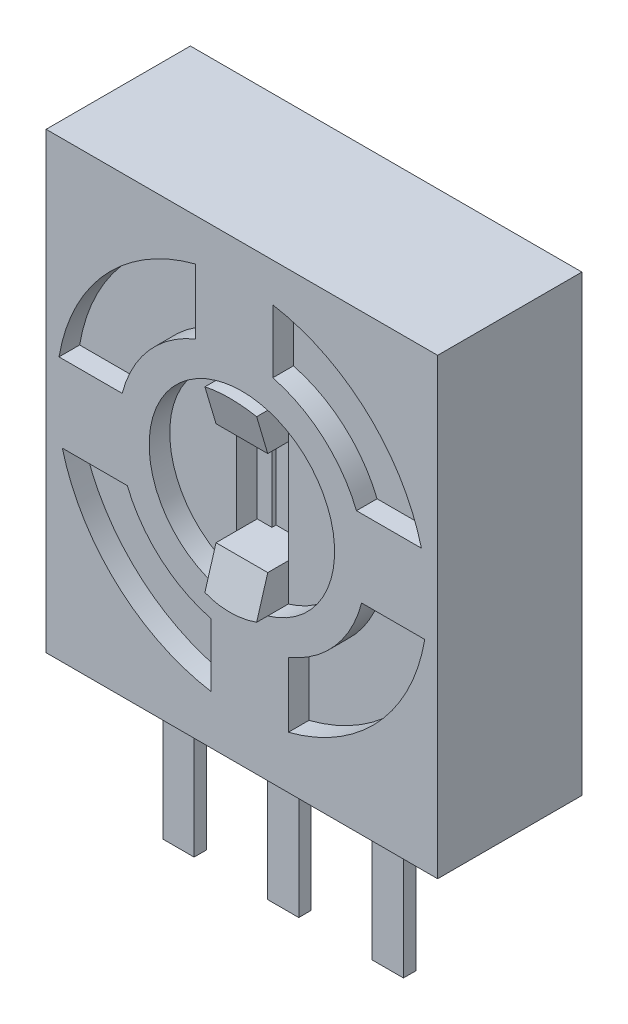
ISO-10303-21;
HEADER;
FILE_DESCRIPTION(('STEP AP214'),'2;1');
FILE_NAME('part.step','',(''),(''),'','','');
FILE_SCHEMA(('AUTOMOTIVE_DESIGN { 1 0 10303 214 1 1 1 1 }'));
ENDSEC;
DATA;
#1=APPLICATION_CONTEXT('core data for automotive mechanical design processes');
#2=APPLICATION_PROTOCOL_DEFINITION('international standard','automotive_design',2000,#1);
#3=PRODUCT_CONTEXT('',#1,'mechanical');
#4=PRODUCT('Part','Part','',(#3));
#5=PRODUCT_RELATED_PRODUCT_CATEGORY('part','',(#4));
#6=PRODUCT_DEFINITION_FORMATION('','',#4);
#7=PRODUCT_DEFINITION_CONTEXT('part definition',#1,'design');
#8=PRODUCT_DEFINITION('design','',#6,#7);
#9=PRODUCT_DEFINITION_SHAPE('','',#8);
#10=(LENGTH_UNIT() NAMED_UNIT(*) SI_UNIT(.MILLI.,.METRE.));
#11=(NAMED_UNIT(*) PLANE_ANGLE_UNIT() SI_UNIT($,.RADIAN.));
#12=(NAMED_UNIT(*) SI_UNIT($,.STERADIAN.) SOLID_ANGLE_UNIT());
#13=UNCERTAINTY_MEASURE_WITH_UNIT(LENGTH_MEASURE(1.E-05),#10,'distance_accuracy_value','');
#14=(GEOMETRIC_REPRESENTATION_CONTEXT(3) GLOBAL_UNCERTAINTY_ASSIGNED_CONTEXT((#13)) GLOBAL_UNIT_ASSIGNED_CONTEXT((#10,
#11,#12)) REPRESENTATION_CONTEXT('',''));
#15=CARTESIAN_POINT('',(0.,0.,0.));
#16=DIRECTION('',(0.,0.,1.));
#17=DIRECTION('',(1.,0.,0.));
#18=AXIS2_PLACEMENT_3D('',#15,#16,#17);
#19=CARTESIAN_POINT('',(4.12225890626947,4.37345679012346,2.5));
#20=DIRECTION('',(0.,0.,1.));
#21=DIRECTION('',(1.,0.,0.));
#22=AXIS2_PLACEMENT_3D('',#19,#20,#21);
#23=PLANE('',#22);
#24=DIRECTION('',(0.,1.,0.));
#25=VECTOR('',#24,1.);
#26=CARTESIAN_POINT('',(5.02050437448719,6.12507875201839,2.5));
#27=LINE('',#26,#25);
#28=CARTESIAN_POINT('',(5.02050437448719,4.37345679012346,2.5));
#29=VERTEX_POINT('',#28);
#30=CARTESIAN_POINT('',(5.02050437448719,6.12507875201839,2.5));
#31=VERTEX_POINT('',#30);
#32=EDGE_CURVE('E756',#29,#31,#27,.T.);
#33=ORIENTED_EDGE('',*,*,#32,.F.);
#34=DIRECTION('',(1.,0.,0.));
#35=VECTOR('',#34,1.);
#36=CARTESIAN_POINT('',(4.12225890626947,4.37345679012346,2.5));
#37=LINE('',#36,#35);
#38=CARTESIAN_POINT('',(5.37774109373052,4.37345679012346,2.5));
#39=VERTEX_POINT('',#38);
#40=EDGE_CURVE('E813',#29,#39,#37,.T.);
#41=ORIENTED_EDGE('',*,*,#40,.T.);
#42=DIRECTION('',(0.,1.,0.));
#43=VECTOR('',#42,1.);
#44=CARTESIAN_POINT('',(5.37774109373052,6.87345679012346,2.5));
#45=LINE('',#44,#43);
#46=CARTESIAN_POINT('',(5.37774109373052,6.12507875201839,2.5));
#47=VERTEX_POINT('',#46);
#48=EDGE_CURVE('E816',#39,#47,#45,.T.);
#49=ORIENTED_EDGE('',*,*,#48,.T.);
#50=DIRECTION('',(1.,0.,0.));
#51=VECTOR('',#50,1.);
#52=CARTESIAN_POINT('',(5.37774109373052,6.12507875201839,2.5));
#53=LINE('',#52,#51);
#54=EDGE_CURVE('E759',#31,#47,#53,.T.);
#55=ORIENTED_EDGE('',*,*,#54,.F.);
#56=EDGE_LOOP('',(#33,#41,#49,#55));
#57=FACE_BOUND('',#56,.T.);
#58=ADVANCED_FACE('F27',(#57),#23,.T.);
#59=DIRECTION('',(-0.642653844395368,0.766156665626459,0.));
#60=VECTOR('',#59,1.);
#61=CARTESIAN_POINT('',(4.74999999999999,6.87345679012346,2.5));
#62=LINE('',#61,#60);
#63=CARTESIAN_POINT('',(4.74999999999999,6.87345679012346,2.5));
#64=VERTEX_POINT('',#63);
#65=EDGE_CURVE('E896',#47,#64,#62,.T.);
#66=ORIENTED_EDGE('',*,*,#65,.F.);
#67=CARTESIAN_POINT('',(5.37774109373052,6.87345679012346,2.5));
#68=VERTEX_POINT('',#67);
#69=EDGE_CURVE('E815',#47,#68,#45,.T.);
#70=ORIENTED_EDGE('',*,*,#69,.T.);
#71=DIRECTION('',(-1.,0.,0.));
#72=VECTOR('',#71,1.);
#73=CARTESIAN_POINT('',(4.12225890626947,6.87345679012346,2.5));
#74=LINE('',#73,#72);
#75=EDGE_CURVE('E820',#68,#64,#74,.T.);
#76=ORIENTED_EDGE('',*,*,#75,.T.);
#77=EDGE_LOOP('',(#66,#70,#76));
#78=FACE_BOUND('',#77,.T.);
#79=ADVANCED_FACE('F708',(#78),#23,.T.);
#80=DIRECTION('',(0.,-1.,0.));
#81=VECTOR('',#80,1.);
#82=CARTESIAN_POINT('',(4.4794956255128,6.12507875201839,2.5));
#83=LINE('',#82,#81);
#84=CARTESIAN_POINT('',(4.4794956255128,6.12507875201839,2.5));
#85=VERTEX_POINT('',#84);
#86=CARTESIAN_POINT('',(4.4794956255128,4.37345679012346,2.5));
#87=VERTEX_POINT('',#86);
#88=EDGE_CURVE('E749',#85,#87,#83,.T.);
#89=ORIENTED_EDGE('',*,*,#88,.F.);
#90=DIRECTION('',(1.,0.,0.));
#91=VECTOR('',#90,1.);
#92=CARTESIAN_POINT('',(4.12225890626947,6.12507875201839,2.5));
#93=LINE('',#92,#91);
#94=CARTESIAN_POINT('',(4.12225890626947,6.12507875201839,2.5));
#95=VERTEX_POINT('',#94);
#96=EDGE_CURVE('E751',#95,#85,#93,.T.);
#97=ORIENTED_EDGE('',*,*,#96,.F.);
#98=DIRECTION('',(0.,-1.,0.));
#99=VECTOR('',#98,1.);
#100=CARTESIAN_POINT('',(4.12225890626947,6.87345679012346,2.5));
#101=LINE('',#100,#99);
#102=CARTESIAN_POINT('',(4.12225890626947,4.37345679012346,2.5));
#103=VERTEX_POINT('',#102);
#104=EDGE_CURVE('E809',#95,#103,#101,.T.);
#105=ORIENTED_EDGE('',*,*,#104,.T.);
#106=EDGE_CURVE('E754',#103,#87,#37,.T.);
#107=ORIENTED_EDGE('',*,*,#106,.T.);
#108=EDGE_LOOP('',(#89,#97,#105,#107));
#109=FACE_BOUND('',#108,.T.);
#110=ADVANCED_FACE('F716',(#109),#23,.T.);
#111=CARTESIAN_POINT('',(4.75,5.62345679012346,3.));
#112=DIRECTION('',(0.,0.,1.));
#113=DIRECTION('',(1.,0.,0.));
#114=AXIS2_PLACEMENT_3D('',#111,#112,#113);
#115=PLANE('',#114);
#116=DIRECTION('',(0.,-1.,0.));
#117=VECTOR('',#116,1.);
#118=CARTESIAN_POINT('',(4.12225890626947,6.87345679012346,3.));
#119=LINE('',#118,#117);
#120=CARTESIAN_POINT('',(4.12225890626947,6.87345679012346,3.));
#121=VERTEX_POINT('',#120);
#122=CARTESIAN_POINT('',(4.12225890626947,4.37345679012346,3.));
#123=VERTEX_POINT('',#122);
#124=EDGE_CURVE('E791',#121,#123,#119,.T.);
#125=ORIENTED_EDGE('',*,*,#124,.F.);
#126=DIRECTION('',(0.,-1.,0.));
#127=VECTOR('',#126,1.);
#128=CARTESIAN_POINT('',(4.12225890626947,7.78411435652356,3.));
#129=LINE('',#128,#127);
#130=CARTESIAN_POINT('',(4.12225890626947,7.78411435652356,3.));
#131=VERTEX_POINT('',#130);
#132=EDGE_CURVE('E367',#131,#121,#129,.T.);
#133=ORIENTED_EDGE('',*,*,#132,.F.);
#134=CARTESIAN_POINT('',(4.75,5.62345679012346,3.));
#135=DIRECTION('',(0.,0.,1.));
#136=DIRECTION('',(1.,0.,0.));
#137=AXIS2_PLACEMENT_3D('',#134,#135,#136);
#138=CIRCLE('',#137,2.25);
#139=CARTESIAN_POINT('',(4.12225890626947,3.46279922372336,3.));
#140=VERTEX_POINT('',#139);
#141=EDGE_CURVE('E609',#131,#140,#138,.T.);
#142=ORIENTED_EDGE('',*,*,#141,.T.);
#143=DIRECTION('',(0.,-1.,0.));
#144=VECTOR('',#143,1.);
#145=CARTESIAN_POINT('',(4.12225890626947,4.37345679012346,3.));
#146=LINE('',#145,#144);
#147=EDGE_CURVE('E836',#123,#140,#146,.T.);
#148=ORIENTED_EDGE('',*,*,#147,.F.);
#149=EDGE_LOOP('',(#125,#133,#142,#148));
#150=FACE_BOUND('',#149,.T.);
#151=ADVANCED_FACE('F735',(#150),#115,.T.);
#152=CARTESIAN_POINT('',(4.75,5.62345679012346,3.));
#153=DIRECTION('',(0.,0.,1.));
#154=DIRECTION('',(1.,0.,0.));
#155=AXIS2_PLACEMENT_3D('',#152,#153,#154);
#156=CYLINDRICAL_SURFACE('',#155,2.25);
#157=DIRECTION('',(0.,0.,-1.));
#158=VECTOR('',#157,1.);
#159=CARTESIAN_POINT('',(5.37774109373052,3.46279922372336,3.8));
#160=LINE('',#159,#158);
#161=CARTESIAN_POINT('',(5.37774109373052,3.46279922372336,3.5));
#162=VERTEX_POINT('',#161);
#163=CARTESIAN_POINT('',(5.37774109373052,3.46279922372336,3.));
#164=VERTEX_POINT('',#163);
#165=EDGE_CURVE('E846',#162,#164,#160,.T.);
#166=ORIENTED_EDGE('',*,*,#165,.F.);
#167=CARTESIAN_POINT('',(4.75,5.62345679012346,3.5));
#168=DIRECTION('',(0.,0.,1.));
#169=DIRECTION('',(1.,0.,0.));
#170=AXIS2_PLACEMENT_3D('',#167,#168,#169);
#171=CIRCLE('',#170,2.25);
#172=CARTESIAN_POINT('',(5.37774109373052,7.78411435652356,3.5));
#173=VERTEX_POINT('',#172);
#174=EDGE_CURVE('E596',#162,#173,#171,.T.);
#175=ORIENTED_EDGE('',*,*,#174,.T.);
#176=DIRECTION('',(0.,0.,-1.));
#177=VECTOR('',#176,1.);
#178=CARTESIAN_POINT('',(5.37774109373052,7.78411435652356,3.8));
#179=LINE('',#178,#177);
#180=CARTESIAN_POINT('',(5.37774109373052,7.78411435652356,3.));
#181=VERTEX_POINT('',#180);
#182=EDGE_CURVE('E852',#173,#181,#179,.T.);
#183=ORIENTED_EDGE('',*,*,#182,.T.);
#184=EDGE_CURVE('E607',#164,#181,#138,.T.);
#185=ORIENTED_EDGE('',*,*,#184,.F.);
#186=EDGE_LOOP('',(#166,#175,#183,#185));
#187=FACE_BOUND('',#186,.T.);
#188=ADVANCED_FACE('F741',(#187),#156,.F.);
#189=DIRECTION('',(0.,0.,-1.));
#190=VECTOR('',#189,1.);
#191=CARTESIAN_POINT('',(4.12225890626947,3.46279922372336,3.8));
#192=LINE('',#191,#190);
#193=CARTESIAN_POINT('',(4.12225890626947,3.46279922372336,3.5));
#194=VERTEX_POINT('',#193);
#195=EDGE_CURVE('E839',#194,#140,#192,.T.);
#196=ORIENTED_EDGE('',*,*,#195,.T.);
#197=ORIENTED_EDGE('',*,*,#141,.F.);
#198=DIRECTION('',(0.,0.,-1.));
#199=VECTOR('',#198,1.);
#200=CARTESIAN_POINT('',(4.12225890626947,7.78411435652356,3.8));
#201=LINE('',#200,#199);
#202=CARTESIAN_POINT('',(4.12225890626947,7.78411435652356,3.5));
#203=VERTEX_POINT('',#202);
#204=EDGE_CURVE('E368',#203,#131,#201,.T.);
#205=ORIENTED_EDGE('',*,*,#204,.F.);
#206=EDGE_CURVE('E608',#203,#194,#171,.T.);
#207=ORIENTED_EDGE('',*,*,#206,.T.);
#208=EDGE_LOOP('',(#196,#197,#205,#207));
#209=FACE_BOUND('',#208,.T.);
#210=ADVANCED_FACE('F883',(#209),#156,.F.);
#211=DIRECTION('',(0.,1.,0.));
#212=VECTOR('',#211,1.);
#213=CARTESIAN_POINT('',(5.37774109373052,6.87345679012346,3.));
#214=LINE('',#213,#212);
#215=CARTESIAN_POINT('',(5.37774109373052,4.37345679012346,3.));
#216=VERTEX_POINT('',#215);
#217=CARTESIAN_POINT('',(5.37774109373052,6.87345679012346,3.));
#218=VERTEX_POINT('',#217);
#219=EDGE_CURVE('E806',#216,#218,#214,.T.);
#220=ORIENTED_EDGE('',*,*,#219,.F.);
#221=DIRECTION('',(0.,1.,0.));
#222=VECTOR('',#221,1.);
#223=CARTESIAN_POINT('',(5.37774109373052,4.37345679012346,3.));
#224=LINE('',#223,#222);
#225=EDGE_CURVE('E826',#164,#216,#224,.T.);
#226=ORIENTED_EDGE('',*,*,#225,.F.);
#227=ORIENTED_EDGE('',*,*,#184,.T.);
#228=DIRECTION('',(0.,1.,0.));
#229=VECTOR('',#228,1.);
#230=CARTESIAN_POINT('',(5.37774109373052,7.78411435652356,3.));
#231=LINE('',#230,#229);
#232=EDGE_CURVE('E850',#218,#181,#231,.T.);
#233=ORIENTED_EDGE('',*,*,#232,.F.);
#234=EDGE_LOOP('',(#220,#226,#227,#233));
#235=FACE_BOUND('',#234,.T.);
#236=ADVANCED_FACE('F744',(#235),#115,.T.);
#237=CARTESIAN_POINT('',(0.,0.,3.5));
#238=DIRECTION('',(0.,1.,0.));
#239=DIRECTION('',(0.,0.,1.));
#240=AXIS2_PLACEMENT_3D('',#237,#238,#239);
#241=PLANE('',#240);
#242=DIRECTION('',(0.,0.,1.));
#243=VECTOR('',#242,1.);
#244=CARTESIAN_POINT('',(7.67,0.,2.5));
#245=LINE('',#244,#243);
#246=CARTESIAN_POINT('',(7.67,0.,2.2));
#247=VERTEX_POINT('',#246);
#248=CARTESIAN_POINT('',(7.67,0.,2.5));
#249=VERTEX_POINT('',#248);
#250=EDGE_CURVE('E409',#247,#249,#245,.T.);
#251=ORIENTED_EDGE('',*,*,#250,.F.);
#252=DIRECTION('',(1.,0.,0.));
#253=VECTOR('',#252,1.);
#254=CARTESIAN_POINT('',(7.67,0.,2.2));
#255=LINE('',#254,#253);
#256=CARTESIAN_POINT('',(6.91,0.,2.2));
#257=VERTEX_POINT('',#256);
#258=EDGE_CURVE('E418',#257,#247,#255,.T.);
#259=ORIENTED_EDGE('',*,*,#258,.F.);
#260=DIRECTION('',(0.,0.,-1.));
#261=VECTOR('',#260,1.);
#262=CARTESIAN_POINT('',(6.91,0.,2.5));
#263=LINE('',#262,#261);
#264=CARTESIAN_POINT('',(6.91,0.,2.5));
#265=VERTEX_POINT('',#264);
#266=EDGE_CURVE('E415',#265,#257,#263,.T.);
#267=ORIENTED_EDGE('',*,*,#266,.F.);
#268=DIRECTION('',(-1.,0.,0.));
#269=VECTOR('',#268,1.);
#270=CARTESIAN_POINT('',(7.67,0.,2.5));
#271=LINE('',#270,#269);
#272=EDGE_CURVE('E412',#249,#265,#271,.T.);
#273=ORIENTED_EDGE('',*,*,#272,.F.);
#274=EDGE_LOOP('',(#251,#259,#267,#273));
#275=FACE_BOUND('',#274,.T.);
#276=DIRECTION('',(1.,0.,0.));
#277=VECTOR('',#276,1.);
#278=CARTESIAN_POINT('',(0.,0.,0.));
#279=LINE('',#278,#277);
#280=CARTESIAN_POINT('',(0.,0.,0.));
#281=VERTEX_POINT('',#280);
#282=CARTESIAN_POINT('',(9.5,0.,0.));
#283=VERTEX_POINT('',#282);
#284=EDGE_CURVE('E615',#281,#283,#279,.T.);
#285=ORIENTED_EDGE('',*,*,#284,.T.);
#286=DIRECTION('',(0.,0.,-1.));
#287=VECTOR('',#286,1.);
#288=CARTESIAN_POINT('',(9.5,0.,3.5));
#289=LINE('',#288,#287);
#290=CARTESIAN_POINT('',(9.5,0.,3.5));
#291=VERTEX_POINT('',#290);
#292=EDGE_CURVE('E636',#291,#283,#289,.T.);
#293=ORIENTED_EDGE('',*,*,#292,.F.);
#294=DIRECTION('',(1.,0.,0.));
#295=VECTOR('',#294,1.);
#296=CARTESIAN_POINT('',(0.,0.,3.5));
#297=LINE('',#296,#295);
#298=CARTESIAN_POINT('',(0.,0.,3.5));
#299=VERTEX_POINT('',#298);
#300=EDGE_CURVE('E624',#299,#291,#297,.T.);
#301=ORIENTED_EDGE('',*,*,#300,.F.);
#302=DIRECTION('',(0.,0.,-1.));
#303=VECTOR('',#302,1.);
#304=CARTESIAN_POINT('',(0.,0.,3.5));
#305=LINE('',#304,#303);
#306=EDGE_CURVE('E35',#299,#281,#305,.T.);
#307=ORIENTED_EDGE('',*,*,#306,.T.);
#308=EDGE_LOOP('',(#285,#293,#301,#307));
#309=FACE_BOUND('',#308,.T.);
#310=DIRECTION('',(0.,0.,1.));
#311=VECTOR('',#310,1.);
#312=CARTESIAN_POINT('',(5.13,0.,2.5));
#313=LINE('',#312,#311);
#314=CARTESIAN_POINT('',(5.13,0.,2.2));
#315=VERTEX_POINT('',#314);
#316=CARTESIAN_POINT('',(5.13,0.,2.5));
#317=VERTEX_POINT('',#316);
#318=EDGE_CURVE('E442',#315,#317,#313,.T.);
#319=ORIENTED_EDGE('',*,*,#318,.F.);
#320=DIRECTION('',(1.,0.,0.));
#321=VECTOR('',#320,1.);
#322=CARTESIAN_POINT('',(5.13,0.,2.2));
#323=LINE('',#322,#321);
#324=CARTESIAN_POINT('',(4.37,0.,2.2));
#325=VERTEX_POINT('',#324);
#326=EDGE_CURVE('E451',#325,#315,#323,.T.);
#327=ORIENTED_EDGE('',*,*,#326,.F.);
#328=DIRECTION('',(0.,0.,-1.));
#329=VECTOR('',#328,1.);
#330=CARTESIAN_POINT('',(4.37,0.,2.5));
#331=LINE('',#330,#329);
#332=CARTESIAN_POINT('',(4.37,0.,2.5));
#333=VERTEX_POINT('',#332);
#334=EDGE_CURVE('E448',#333,#325,#331,.T.);
#335=ORIENTED_EDGE('',*,*,#334,.F.);
#336=DIRECTION('',(-1.,0.,0.));
#337=VECTOR('',#336,1.);
#338=CARTESIAN_POINT('',(5.13,0.,2.5));
#339=LINE('',#338,#337);
#340=EDGE_CURVE('E445',#317,#333,#339,.T.);
#341=ORIENTED_EDGE('',*,*,#340,.F.);
#342=EDGE_LOOP('',(#319,#327,#335,#341));
#343=FACE_BOUND('',#342,.T.);
#344=DIRECTION('',(0.,0.,1.));
#345=VECTOR('',#344,1.);
#346=CARTESIAN_POINT('',(2.59,0.,2.49999999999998));
#347=LINE('',#346,#345);
#348=CARTESIAN_POINT('',(2.59,0.,2.19999999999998));
#349=VERTEX_POINT('',#348);
#350=CARTESIAN_POINT('',(2.59,0.,2.49999999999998));
#351=VERTEX_POINT('',#350);
#352=EDGE_CURVE('E376',#349,#351,#347,.T.);
#353=ORIENTED_EDGE('',*,*,#352,.F.);
#354=DIRECTION('',(1.,0.,0.));
#355=VECTOR('',#354,1.);
#356=CARTESIAN_POINT('',(2.59,0.,2.19999999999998));
#357=LINE('',#356,#355);
#358=CARTESIAN_POINT('',(1.83,0.,2.19999999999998));
#359=VERTEX_POINT('',#358);
#360=EDGE_CURVE('E385',#359,#349,#357,.T.);
#361=ORIENTED_EDGE('',*,*,#360,.F.);
#362=DIRECTION('',(0.,0.,-1.));
#363=VECTOR('',#362,1.);
#364=CARTESIAN_POINT('',(1.83,0.,2.49999999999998));
#365=LINE('',#364,#363);
#366=CARTESIAN_POINT('',(1.83,0.,2.49999999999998));
#367=VERTEX_POINT('',#366);
#368=EDGE_CURVE('E382',#367,#359,#365,.T.);
#369=ORIENTED_EDGE('',*,*,#368,.F.);
#370=DIRECTION('',(-1.,0.,0.));
#371=VECTOR('',#370,1.);
#372=CARTESIAN_POINT('',(2.59,0.,2.49999999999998));
#373=LINE('',#372,#371);
#374=EDGE_CURVE('E379',#351,#367,#373,.T.);
#375=ORIENTED_EDGE('',*,*,#374,.F.);
#376=EDGE_LOOP('',(#353,#361,#369,#375));
#377=FACE_BOUND('',#376,.T.);
#378=ADVANCED_FACE('F641',(#275,#309,#343,#377),#241,.F.);
#379=CARTESIAN_POINT('',(0.,0.,3.5));
#380=DIRECTION('',(1.,0.,0.));
#381=DIRECTION('',(0.,0.,-1.));
#382=AXIS2_PLACEMENT_3D('',#379,#380,#381);
#383=PLANE('',#382);
#384=DIRECTION('',(0.,-1.,0.));
#385=VECTOR('',#384,1.);
#386=CARTESIAN_POINT('',(0.,0.,0.));
#387=LINE('',#386,#385);
#388=CARTESIAN_POINT('',(0.,11.,0.));
#389=VERTEX_POINT('',#388);
#390=EDGE_CURVE('E612',#389,#281,#387,.T.);
#391=ORIENTED_EDGE('',*,*,#390,.T.);
#392=ORIENTED_EDGE('',*,*,#306,.F.);
#393=DIRECTION('',(0.,-1.,0.));
#394=VECTOR('',#393,1.);
#395=CARTESIAN_POINT('',(0.,0.,3.5));
#396=LINE('',#395,#394);
#397=CARTESIAN_POINT('',(0.,11.,3.5));
#398=VERTEX_POINT('',#397);
#399=EDGE_CURVE('E621',#398,#299,#396,.T.);
#400=ORIENTED_EDGE('',*,*,#399,.F.);
#401=DIRECTION('',(0.,0.,-1.));
#402=VECTOR('',#401,1.);
#403=CARTESIAN_POINT('',(0.,11.,3.5));
#404=LINE('',#403,#402);
#405=EDGE_CURVE('E630',#398,#389,#404,.T.);
#406=ORIENTED_EDGE('',*,*,#405,.T.);
#407=EDGE_LOOP('',(#391,#392,#400,#406));
#408=FACE_BOUND('',#407,.T.);
#409=ADVANCED_FACE('F29',(#408),#383,.F.);
#410=CARTESIAN_POINT('',(9.5,0.,3.5));
#411=DIRECTION('',(-1.,0.,0.));
#412=DIRECTION('',(0.,0.,1.));
#413=AXIS2_PLACEMENT_3D('',#410,#411,#412);
#414=PLANE('',#413);
#415=DIRECTION('',(0.,1.,0.));
#416=VECTOR('',#415,1.);
#417=CARTESIAN_POINT('',(9.5,0.,0.));
#418=LINE('',#417,#416);
#419=CARTESIAN_POINT('',(9.5,11.,0.));
#420=VERTEX_POINT('',#419);
#421=EDGE_CURVE('E617',#283,#420,#418,.T.);
#422=ORIENTED_EDGE('',*,*,#421,.T.);
#423=DIRECTION('',(0.,0.,-1.));
#424=VECTOR('',#423,1.);
#425=CARTESIAN_POINT('',(9.5,11.,3.5));
#426=LINE('',#425,#424);
#427=CARTESIAN_POINT('',(9.5,11.,3.5));
#428=VERTEX_POINT('',#427);
#429=EDGE_CURVE('E633',#428,#420,#426,.T.);
#430=ORIENTED_EDGE('',*,*,#429,.F.);
#431=DIRECTION('',(0.,1.,0.));
#432=VECTOR('',#431,1.);
#433=CARTESIAN_POINT('',(9.5,0.,3.5));
#434=LINE('',#433,#432);
#435=EDGE_CURVE('E626',#291,#428,#434,.T.);
#436=ORIENTED_EDGE('',*,*,#435,.F.);
#437=ORIENTED_EDGE('',*,*,#292,.T.);
#438=EDGE_LOOP('',(#422,#430,#436,#437));
#439=FACE_BOUND('',#438,.T.);
#440=ADVANCED_FACE('F654',(#439),#414,.F.);
#441=CARTESIAN_POINT('',(0.,11.,3.5));
#442=DIRECTION('',(0.,-1.,0.));
#443=DIRECTION('',(0.,0.,-1.));
#444=AXIS2_PLACEMENT_3D('',#441,#442,#443);
#445=PLANE('',#444);
#446=DIRECTION('',(-1.,0.,0.));
#447=VECTOR('',#446,1.);
#448=CARTESIAN_POINT('',(0.,11.,0.));
#449=LINE('',#448,#447);
#450=EDGE_CURVE('E619',#420,#389,#449,.T.);
#451=ORIENTED_EDGE('',*,*,#450,.T.);
#452=ORIENTED_EDGE('',*,*,#405,.F.);
#453=DIRECTION('',(-1.,0.,0.));
#454=VECTOR('',#453,1.);
#455=CARTESIAN_POINT('',(0.,11.,3.5));
#456=LINE('',#455,#454);
#457=EDGE_CURVE('E628',#428,#398,#456,.T.);
#458=ORIENTED_EDGE('',*,*,#457,.F.);
#459=ORIENTED_EDGE('',*,*,#429,.T.);
#460=EDGE_LOOP('',(#451,#452,#458,#459));
#461=FACE_BOUND('',#460,.T.);
#462=ADVANCED_FACE('F658',(#461),#445,.F.);
#463=CARTESIAN_POINT('',(0.,11.,3.5));
#464=DIRECTION('',(0.,0.,-1.));
#465=DIRECTION('',(-1.,0.,0.));
#466=AXIS2_PLACEMENT_3D('',#463,#464,#465);
#467=PLANE('',#466);
#468=DIRECTION('',(1.,0.,0.));
#469=VECTOR('',#468,1.);
#470=CARTESIAN_POINT('',(7.53044967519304,6.75,3.5));
#471=LINE('',#470,#469);
#472=CARTESIAN_POINT('',(7.53044967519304,6.75,3.5));
#473=VERTEX_POINT('',#472);
#474=CARTESIAN_POINT('',(9.10670751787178,6.7499999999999,3.5));
#475=VERTEX_POINT('',#474);
#476=EDGE_CURVE('E578',#473,#475,#471,.T.);
#477=ORIENTED_EDGE('',*,*,#476,.F.);
#478=CARTESIAN_POINT('',(4.75,5.62345679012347,3.5));
#479=DIRECTION('',(0.,0.,-1.));
#480=DIRECTION('',(-1.,0.,0.));
#481=AXIS2_PLACEMENT_3D('',#478,#479,#480);
#482=CIRCLE('',#481,3.);
#483=CARTESIAN_POINT('',(5.5,8.52819429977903,3.5));
#484=VERTEX_POINT('',#483);
#485=EDGE_CURVE('E576',#484,#473,#482,.T.);
#486=ORIENTED_EDGE('',*,*,#485,.F.);
#487=DIRECTION('',(0.,-1.,0.));
#488=VECTOR('',#487,1.);
#489=CARTESIAN_POINT('',(5.5,10.0605166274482,3.5));
#490=LINE('',#489,#488);
#491=CARTESIAN_POINT('',(5.5,10.0605166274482,3.5));
#492=VERTEX_POINT('',#491);
#493=EDGE_CURVE('E573',#492,#484,#490,.T.);
#494=ORIENTED_EDGE('',*,*,#493,.F.);
#495=CARTESIAN_POINT('',(4.75,5.62345679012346,3.5));
#496=DIRECTION('',(0.,0.,1.));
#497=DIRECTION('',(-1.,0.,0.));
#498=AXIS2_PLACEMENT_3D('',#495,#496,#497);
#499=CIRCLE('',#498,4.49999999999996);
#500=EDGE_CURVE('E564',#475,#492,#499,.T.);
#501=ORIENTED_EDGE('',*,*,#500,.F.);
#502=EDGE_LOOP('',(#477,#486,#494,#501));
#503=FACE_BOUND('',#502,.T.);
#504=ORIENTED_EDGE('',*,*,#435,.T.);
#505=ORIENTED_EDGE('',*,*,#457,.T.);
#506=ORIENTED_EDGE('',*,*,#399,.T.);
#507=ORIENTED_EDGE('',*,*,#300,.T.);
#508=EDGE_LOOP('',(#504,#505,#506,#507));
#509=FACE_BOUND('',#508,.T.);
#510=DIRECTION('',(-1.,0.,0.));
#511=VECTOR('',#510,1.);
#512=CARTESIAN_POINT('',(9.1870598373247,4.87345679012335,3.5));
#513=LINE('',#512,#511);
#514=CARTESIAN_POINT('',(9.1870598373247,4.87345679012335,3.5));
#515=VERTEX_POINT('',#514);
#516=CARTESIAN_POINT('',(7.65473750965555,4.87345679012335,3.5));
#517=VERTEX_POINT('',#516);
#518=EDGE_CURVE('E541',#515,#517,#513,.T.);
#519=ORIENTED_EDGE('',*,*,#518,.F.);
#520=CARTESIAN_POINT('',(4.75000000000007,5.62345679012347,3.5));
#521=DIRECTION('',(0.,0.,1.));
#522=DIRECTION('',(-1.,0.,0.));
#523=AXIS2_PLACEMENT_3D('',#520,#521,#522);
#524=CIRCLE('',#523,4.49999999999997);
#525=CARTESIAN_POINT('',(5.87654320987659,1.26674927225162,3.5));
#526=VERTEX_POINT('',#525);
#527=EDGE_CURVE('E533',#526,#515,#524,.T.);
#528=ORIENTED_EDGE('',*,*,#527,.F.);
#529=DIRECTION('',(0.,-1.,0.));
#530=VECTOR('',#529,1.);
#531=CARTESIAN_POINT('',(5.8765432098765,2.84300711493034,3.5));
#532=LINE('',#531,#530);
#533=CARTESIAN_POINT('',(5.87654320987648,2.84300711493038,3.5));
#534=VERTEX_POINT('',#533);
#535=EDGE_CURVE('E546',#534,#526,#532,.T.);
#536=ORIENTED_EDGE('',*,*,#535,.F.);
#537=CARTESIAN_POINT('',(4.75000000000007,5.62345679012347,3.5));
#538=DIRECTION('',(0.,0.,-1.));
#539=DIRECTION('',(-1.,0.,0.));
#540=AXIS2_PLACEMENT_3D('',#537,#538,#539);
#541=CIRCLE('',#540,3.);
#542=EDGE_CURVE('E544',#517,#534,#541,.T.);
#543=ORIENTED_EDGE('',*,*,#542,.F.);
#544=EDGE_LOOP('',(#519,#528,#536,#543));
#545=FACE_BOUND('',#544,.T.);
#546=EDGE_CURVE('E604',#173,#203,#171,.T.);
#547=ORIENTED_EDGE('',*,*,#546,.F.);
#548=ORIENTED_EDGE('',*,*,#174,.F.);
#549=EDGE_CURVE('E875',#194,#162,#171,.T.);
#550=ORIENTED_EDGE('',*,*,#549,.F.);
#551=ORIENTED_EDGE('',*,*,#206,.F.);
#552=EDGE_LOOP('',(#547,#548,#550,#551));
#553=FACE_BOUND('',#552,.T.);
#554=DIRECTION('',(1.,0.,0.));
#555=VECTOR('',#554,1.);
#556=CARTESIAN_POINT('',(0.312940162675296,6.37345679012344,3.5));
#557=LINE('',#556,#555);
#558=CARTESIAN_POINT('',(0.312940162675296,6.37345679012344,3.5));
#559=VERTEX_POINT('',#558);
#560=CARTESIAN_POINT('',(1.84526249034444,6.37345679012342,3.5));
#561=VERTEX_POINT('',#560);
#562=EDGE_CURVE('E477',#559,#561,#557,.T.);
#563=ORIENTED_EDGE('',*,*,#562,.F.);
#564=CARTESIAN_POINT('',(4.75,5.62345679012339,3.5));
#565=DIRECTION('',(0.,0.,1.));
#566=DIRECTION('',(-1.,0.,0.));
#567=AXIS2_PLACEMENT_3D('',#564,#565,#566);
#568=CIRCLE('',#567,4.5);
#569=CARTESIAN_POINT('',(3.62345679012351,9.98016430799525,3.5));
#570=VERTEX_POINT('',#569);
#571=EDGE_CURVE('E475',#570,#559,#568,.T.);
#572=ORIENTED_EDGE('',*,*,#571,.F.);
#573=DIRECTION('',(0.,1.,0.));
#574=VECTOR('',#573,1.);
#575=CARTESIAN_POINT('',(3.6234567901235,8.40390646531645,3.5));
#576=LINE('',#575,#574);
#577=CARTESIAN_POINT('',(3.6234567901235,8.40390646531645,3.5));
#578=VERTEX_POINT('',#577);
#579=EDGE_CURVE('E483',#578,#570,#576,.T.);
#580=ORIENTED_EDGE('',*,*,#579,.F.);
#581=CARTESIAN_POINT('',(4.75,5.62345679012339,3.5));
#582=DIRECTION('',(0.,0.,-1.));
#583=DIRECTION('',(-1.,0.,0.));
#584=AXIS2_PLACEMENT_3D('',#581,#582,#583);
#585=CIRCLE('',#584,3.);
#586=EDGE_CURVE('E480',#561,#578,#585,.T.);
#587=ORIENTED_EDGE('',*,*,#586,.F.);
#588=EDGE_LOOP('',(#563,#572,#580,#587));
#589=FACE_BOUND('',#588,.T.);
#590=DIRECTION('',(0.,1.,0.));
#591=VECTOR('',#590,1.);
#592=CARTESIAN_POINT('',(4.00000000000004,1.18639695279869,3.5));
#593=LINE('',#592,#591);
#594=CARTESIAN_POINT('',(4.00000000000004,1.18639695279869,3.5));
#595=VERTEX_POINT('',#594);
#596=CARTESIAN_POINT('',(4.00000000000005,2.71871928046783,3.5));
#597=VERTEX_POINT('',#596);
#598=EDGE_CURVE('E509',#595,#597,#593,.T.);
#599=ORIENTED_EDGE('',*,*,#598,.F.);
#600=CARTESIAN_POINT('',(4.75000000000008,5.6234567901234,3.5));
#601=DIRECTION('',(0.,0.,1.));
#602=DIRECTION('',(-1.,0.,0.));
#603=AXIS2_PLACEMENT_3D('',#600,#601,#602);
#604=CIRCLE('',#603,4.5);
#605=CARTESIAN_POINT('',(0.393292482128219,4.49691358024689,3.5));
#606=VERTEX_POINT('',#605);
#607=EDGE_CURVE('E501',#606,#595,#604,.T.);
#608=ORIENTED_EDGE('',*,*,#607,.F.);
#609=DIRECTION('',(-1.,0.,0.));
#610=VECTOR('',#609,1.);
#611=CARTESIAN_POINT('',(1.96955032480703,4.49691358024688,3.5));
#612=LINE('',#611,#610);
#613=CARTESIAN_POINT('',(1.96955032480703,4.49691358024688,3.5));
#614=VERTEX_POINT('',#613);
#615=EDGE_CURVE('E515',#614,#606,#612,.T.);
#616=ORIENTED_EDGE('',*,*,#615,.F.);
#617=CARTESIAN_POINT('',(4.75000000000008,5.62345679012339,3.5));
#618=DIRECTION('',(0.,0.,-1.));
#619=DIRECTION('',(-1.,0.,0.));
#620=AXIS2_PLACEMENT_3D('',#617,#618,#619);
#621=CIRCLE('',#620,3.);
#622=EDGE_CURVE('E512',#597,#614,#621,.T.);
#623=ORIENTED_EDGE('',*,*,#622,.F.);
#624=EDGE_LOOP('',(#599,#608,#616,#623));
#625=FACE_BOUND('',#624,.T.);
#626=ADVANCED_FACE('F660',(#503,#509,#545,#553,#589,#625),#467,.F.);
#627=CARTESIAN_POINT('',(0.,11.,0.));
#628=DIRECTION('',(0.,0.,-1.));
#629=DIRECTION('',(-1.,0.,0.));
#630=AXIS2_PLACEMENT_3D('',#627,#628,#629);
#631=PLANE('',#630);
#632=ORIENTED_EDGE('',*,*,#390,.F.);
#633=ORIENTED_EDGE('',*,*,#450,.F.);
#634=ORIENTED_EDGE('',*,*,#421,.F.);
#635=ORIENTED_EDGE('',*,*,#284,.F.);
#636=EDGE_LOOP('',(#632,#633,#634,#635));
#637=FACE_BOUND('',#636,.T.);
#638=ADVANCED_FACE('F650',(#637),#631,.T.);
#639=CARTESIAN_POINT('',(4.75,5.62345679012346,3.));
#640=DIRECTION('',(0.,0.,1.));
#641=DIRECTION('',(1.,0.,0.));
#642=AXIS2_PLACEMENT_3D('',#639,#640,#641);
#643=CYLINDRICAL_SURFACE('',#642,4.49999999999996);
#644=ORIENTED_EDGE('',*,*,#500,.T.);
#645=DIRECTION('',(0.,0.,1.));
#646=VECTOR('',#645,1.);
#647=CARTESIAN_POINT('',(5.5,10.0605166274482,3.));
#648=LINE('',#647,#646);
#649=CARTESIAN_POINT('',(5.5,10.0605166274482,3.));
#650=VERTEX_POINT('',#649);
#651=EDGE_CURVE('E593',#650,#492,#648,.T.);
#652=ORIENTED_EDGE('',*,*,#651,.F.);
#653=CARTESIAN_POINT('',(4.75,5.62345679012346,3.));
#654=DIRECTION('',(0.,0.,1.));
#655=DIRECTION('',(-1.,0.,0.));
#656=AXIS2_PLACEMENT_3D('',#653,#654,#655);
#657=CIRCLE('',#656,4.49999999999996);
#658=CARTESIAN_POINT('',(9.10670751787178,6.7499999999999,3.));
#659=VERTEX_POINT('',#658);
#660=EDGE_CURVE('E581',#659,#650,#657,.T.);
#661=ORIENTED_EDGE('',*,*,#660,.F.);
#662=DIRECTION('',(0.,0.,1.));
#663=VECTOR('',#662,1.);
#664=CARTESIAN_POINT('',(9.10670751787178,6.7499999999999,3.));
#665=LINE('',#664,#663);
#666=EDGE_CURVE('E594',#659,#475,#665,.T.);
#667=ORIENTED_EDGE('',*,*,#666,.T.);
#668=EDGE_LOOP('',(#644,#652,#661,#667));
#669=FACE_BOUND('',#668,.T.);
#670=ADVANCED_FACE('F1051',(#669),#643,.F.);
#671=CARTESIAN_POINT('',(7.53044967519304,6.75,3.));
#672=DIRECTION('',(0.,-1.,0.));
#673=DIRECTION('',(1.,0.,0.));
#674=AXIS2_PLACEMENT_3D('',#671,#672,#673);
#675=PLANE('',#674);
#676=ORIENTED_EDGE('',*,*,#476,.T.);
#677=ORIENTED_EDGE('',*,*,#666,.F.);
#678=DIRECTION('',(1.,0.,0.));
#679=VECTOR('',#678,1.);
#680=CARTESIAN_POINT('',(7.53044967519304,6.75,3.));
#681=LINE('',#680,#679);
#682=CARTESIAN_POINT('',(7.53044967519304,6.75,3.));
#683=VERTEX_POINT('',#682);
#684=EDGE_CURVE('E590',#683,#659,#681,.T.);
#685=ORIENTED_EDGE('',*,*,#684,.F.);
#686=DIRECTION('',(0.,0.,1.));
#687=VECTOR('',#686,1.);
#688=CARTESIAN_POINT('',(7.53044967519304,6.75,3.));
#689=LINE('',#688,#687);
#690=EDGE_CURVE('E597',#683,#473,#689,.T.);
#691=ORIENTED_EDGE('',*,*,#690,.T.);
#692=EDGE_LOOP('',(#676,#677,#685,#691));
#693=FACE_BOUND('',#692,.T.);
#694=ADVANCED_FACE('F1044',(#693),#675,.F.);
#695=CARTESIAN_POINT('',(4.75,5.62345679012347,3.));
#696=DIRECTION('',(0.,0.,1.));
#697=DIRECTION('',(1.,0.,0.));
#698=AXIS2_PLACEMENT_3D('',#695,#696,#697);
#699=CYLINDRICAL_SURFACE('',#698,3.);
#700=ORIENTED_EDGE('',*,*,#485,.T.);
#701=ORIENTED_EDGE('',*,*,#690,.F.);
#702=CARTESIAN_POINT('',(4.75,5.62345679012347,3.));
#703=DIRECTION('',(0.,0.,-1.));
#704=DIRECTION('',(-1.,0.,0.));
#705=AXIS2_PLACEMENT_3D('',#702,#703,#704);
#706=CIRCLE('',#705,3.);
#707=CARTESIAN_POINT('',(5.5,8.52819429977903,3.));
#708=VERTEX_POINT('',#707);
#709=EDGE_CURVE('E587',#708,#683,#706,.T.);
#710=ORIENTED_EDGE('',*,*,#709,.F.);
#711=DIRECTION('',(0.,0.,1.));
#712=VECTOR('',#711,1.);
#713=CARTESIAN_POINT('',(5.5,8.52819429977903,3.));
#714=LINE('',#713,#712);
#715=EDGE_CURVE('E600',#708,#484,#714,.T.);
#716=ORIENTED_EDGE('',*,*,#715,.T.);
#717=EDGE_LOOP('',(#700,#701,#710,#716));
#718=FACE_BOUND('',#717,.T.);
#719=ADVANCED_FACE('F1039',(#718),#699,.T.);
#720=CARTESIAN_POINT('',(5.5,10.0605166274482,3.));
#721=DIRECTION('',(-1.,0.,0.));
#722=DIRECTION('',(0.,0.,1.));
#723=AXIS2_PLACEMENT_3D('',#720,#721,#722);
#724=PLANE('',#723);
#725=ORIENTED_EDGE('',*,*,#493,.T.);
#726=ORIENTED_EDGE('',*,*,#715,.F.);
#727=DIRECTION('',(0.,-1.,0.));
#728=VECTOR('',#727,1.);
#729=CARTESIAN_POINT('',(5.5,10.0605166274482,3.));
#730=LINE('',#729,#728);
#731=EDGE_CURVE('E584',#650,#708,#730,.T.);
#732=ORIENTED_EDGE('',*,*,#731,.F.);
#733=ORIENTED_EDGE('',*,*,#651,.T.);
#734=EDGE_LOOP('',(#725,#726,#732,#733));
#735=FACE_BOUND('',#734,.T.);
#736=ADVANCED_FACE('F1043',(#735),#724,.F.);
#737=CARTESIAN_POINT('',(4.75,5.62345679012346,3.));
#738=DIRECTION('',(0.,0.,-1.));
#739=DIRECTION('',(-1.,0.,0.));
#740=AXIS2_PLACEMENT_3D('',#737,#738,#739);
#741=PLANE('',#740);
#742=ORIENTED_EDGE('',*,*,#660,.T.);
#743=ORIENTED_EDGE('',*,*,#731,.T.);
#744=ORIENTED_EDGE('',*,*,#709,.T.);
#745=ORIENTED_EDGE('',*,*,#684,.T.);
#746=EDGE_LOOP('',(#742,#743,#744,#745));
#747=FACE_BOUND('',#746,.T.);
#748=ADVANCED_FACE('F1033',(#747),#741,.F.);
#749=CARTESIAN_POINT('',(4.75000000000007,5.62345679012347,3.));
#750=DIRECTION('',(0.,0.,1.));
#751=DIRECTION('',(1.,0.,0.));
#752=AXIS2_PLACEMENT_3D('',#749,#750,#751);
#753=CYLINDRICAL_SURFACE('',#752,4.49999999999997);
#754=ORIENTED_EDGE('',*,*,#527,.T.);
#755=DIRECTION('',(0.,0.,1.));
#756=VECTOR('',#755,1.);
#757=CARTESIAN_POINT('',(9.1870598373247,4.87345679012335,3.));
#758=LINE('',#757,#756);
#759=CARTESIAN_POINT('',(9.1870598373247,4.87345679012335,3.));
#760=VERTEX_POINT('',#759);
#761=EDGE_CURVE('E561',#760,#515,#758,.T.);
#762=ORIENTED_EDGE('',*,*,#761,.F.);
#763=CARTESIAN_POINT('',(4.75000000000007,5.62345679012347,3.));
#764=DIRECTION('',(0.,0.,1.));
#765=DIRECTION('',(-1.,0.,0.));
#766=AXIS2_PLACEMENT_3D('',#763,#764,#765);
#767=CIRCLE('',#766,4.49999999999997);
#768=CARTESIAN_POINT('',(5.87654320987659,1.26674927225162,3.));
#769=VERTEX_POINT('',#768);
#770=EDGE_CURVE('E549',#769,#760,#767,.T.);
#771=ORIENTED_EDGE('',*,*,#770,.F.);
#772=DIRECTION('',(0.,0.,1.));
#773=VECTOR('',#772,1.);
#774=CARTESIAN_POINT('',(5.87654320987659,1.26674927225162,3.));
#775=LINE('',#774,#773);
#776=EDGE_CURVE('E562',#769,#526,#775,.T.);
#777=ORIENTED_EDGE('',*,*,#776,.T.);
#778=EDGE_LOOP('',(#754,#762,#771,#777));
#779=FACE_BOUND('',#778,.T.);
#780=ADVANCED_FACE('F1029',(#779),#753,.F.);
#781=CARTESIAN_POINT('',(5.8765432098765,2.84300711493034,3.));
#782=DIRECTION('',(-1.,0.,0.));
#783=DIRECTION('',(0.,-1.,0.));
#784=AXIS2_PLACEMENT_3D('',#781,#782,#783);
#785=PLANE('',#784);
#786=ORIENTED_EDGE('',*,*,#535,.T.);
#787=ORIENTED_EDGE('',*,*,#776,.F.);
#788=DIRECTION('',(0.,-1.,0.));
#789=VECTOR('',#788,1.);
#790=CARTESIAN_POINT('',(5.8765432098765,2.84300711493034,3.));
#791=LINE('',#790,#789);
#792=CARTESIAN_POINT('',(5.87654320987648,2.84300711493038,3.));
#793=VERTEX_POINT('',#792);
#794=EDGE_CURVE('E558',#793,#769,#791,.T.);
#795=ORIENTED_EDGE('',*,*,#794,.F.);
#796=DIRECTION('',(0.,0.,1.));
#797=VECTOR('',#796,1.);
#798=CARTESIAN_POINT('',(5.87654320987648,2.84300711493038,3.));
#799=LINE('',#798,#797);
#800=EDGE_CURVE('E565',#793,#534,#799,.T.);
#801=ORIENTED_EDGE('',*,*,#800,.T.);
#802=EDGE_LOOP('',(#786,#787,#795,#801));
#803=FACE_BOUND('',#802,.T.);
#804=ADVANCED_FACE('F1022',(#803),#785,.F.);
#805=CARTESIAN_POINT('',(4.75000000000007,5.62345679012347,3.));
#806=DIRECTION('',(0.,0.,1.));
#807=DIRECTION('',(1.,0.,0.));
#808=AXIS2_PLACEMENT_3D('',#805,#806,#807);
#809=CYLINDRICAL_SURFACE('',#808,3.);
#810=ORIENTED_EDGE('',*,*,#542,.T.);
#811=ORIENTED_EDGE('',*,*,#800,.F.);
#812=CARTESIAN_POINT('',(4.75000000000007,5.62345679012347,3.));
#813=DIRECTION('',(0.,0.,-1.));
#814=DIRECTION('',(-1.,0.,0.));
#815=AXIS2_PLACEMENT_3D('',#812,#813,#814);
#816=CIRCLE('',#815,3.);
#817=CARTESIAN_POINT('',(7.65473750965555,4.87345679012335,3.));
#818=VERTEX_POINT('',#817);
#819=EDGE_CURVE('E555',#818,#793,#816,.T.);
#820=ORIENTED_EDGE('',*,*,#819,.F.);
#821=DIRECTION('',(0.,0.,1.));
#822=VECTOR('',#821,1.);
#823=CARTESIAN_POINT('',(7.65473750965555,4.87345679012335,3.));
#824=LINE('',#823,#822);
#825=EDGE_CURVE('E568',#818,#517,#824,.T.);
#826=ORIENTED_EDGE('',*,*,#825,.T.);
#827=EDGE_LOOP('',(#810,#811,#820,#826));
#828=FACE_BOUND('',#827,.T.);
#829=ADVANCED_FACE('F1017',(#828),#809,.T.);
#830=CARTESIAN_POINT('',(9.1870598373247,4.87345679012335,3.));
#831=DIRECTION('',(0.,1.,0.));
#832=DIRECTION('',(0.,0.,1.));
#833=AXIS2_PLACEMENT_3D('',#830,#831,#832);
#834=PLANE('',#833);
#835=ORIENTED_EDGE('',*,*,#518,.T.);
#836=ORIENTED_EDGE('',*,*,#825,.F.);
#837=DIRECTION('',(-1.,0.,0.));
#838=VECTOR('',#837,1.);
#839=CARTESIAN_POINT('',(9.1870598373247,4.87345679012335,3.));
#840=LINE('',#839,#838);
#841=EDGE_CURVE('E552',#760,#818,#840,.T.);
#842=ORIENTED_EDGE('',*,*,#841,.F.);
#843=ORIENTED_EDGE('',*,*,#761,.T.);
#844=EDGE_LOOP('',(#835,#836,#842,#843));
#845=FACE_BOUND('',#844,.T.);
#846=ADVANCED_FACE('F1021',(#845),#834,.F.);
#847=CARTESIAN_POINT('',(4.75000000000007,5.62345679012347,3.));
#848=DIRECTION('',(0.,0.,-1.));
#849=DIRECTION('',(-1.,0.,0.));
#850=AXIS2_PLACEMENT_3D('',#847,#848,#849);
#851=PLANE('',#850);
#852=ORIENTED_EDGE('',*,*,#770,.T.);
#853=ORIENTED_EDGE('',*,*,#841,.T.);
#854=ORIENTED_EDGE('',*,*,#819,.T.);
#855=ORIENTED_EDGE('',*,*,#794,.T.);
#856=EDGE_LOOP('',(#852,#853,#854,#855));
#857=FACE_BOUND('',#856,.T.);
#858=ADVANCED_FACE('F1291',(#857),#851,.F.);
#859=CARTESIAN_POINT('',(4.75000000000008,5.6234567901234,3.));
#860=DIRECTION('',(0.,0.,1.));
#861=DIRECTION('',(1.,0.,0.));
#862=AXIS2_PLACEMENT_3D('',#859,#860,#861);
#863=CYLINDRICAL_SURFACE('',#862,4.5);
#864=ORIENTED_EDGE('',*,*,#607,.T.);
#865=DIRECTION('',(0.,0.,1.));
#866=VECTOR('',#865,1.);
#867=CARTESIAN_POINT('',(4.00000000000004,1.18639695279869,3.));
#868=LINE('',#867,#866);
#869=CARTESIAN_POINT('',(4.00000000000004,1.18639695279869,3.));
#870=VERTEX_POINT('',#869);
#871=EDGE_CURVE('E530',#870,#595,#868,.T.);
#872=ORIENTED_EDGE('',*,*,#871,.F.);
#873=CARTESIAN_POINT('',(4.75000000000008,5.6234567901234,3.));
#874=DIRECTION('',(0.,0.,1.));
#875=DIRECTION('',(-1.,0.,0.));
#876=AXIS2_PLACEMENT_3D('',#873,#874,#875);
#877=CIRCLE('',#876,4.5);
#878=CARTESIAN_POINT('',(0.393292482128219,4.49691358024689,3.));
#879=VERTEX_POINT('',#878);
#880=EDGE_CURVE('E518',#879,#870,#877,.T.);
#881=ORIENTED_EDGE('',*,*,#880,.F.);
#882=DIRECTION('',(0.,0.,1.));
#883=VECTOR('',#882,1.);
#884=CARTESIAN_POINT('',(0.393292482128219,4.49691358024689,3.));
#885=LINE('',#884,#883);
#886=EDGE_CURVE('E531',#879,#606,#885,.T.);
#887=ORIENTED_EDGE('',*,*,#886,.T.);
#888=EDGE_LOOP('',(#864,#872,#881,#887));
#889=FACE_BOUND('',#888,.T.);
#890=ADVANCED_FACE('F687',(#889),#863,.F.);
#891=CARTESIAN_POINT('',(1.96955032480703,4.49691358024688,3.));
#892=DIRECTION('',(0.,1.,0.));
#893=DIRECTION('',(-1.,0.,0.));
#894=AXIS2_PLACEMENT_3D('',#891,#892,#893);
#895=PLANE('',#894);
#896=ORIENTED_EDGE('',*,*,#615,.T.);
#897=ORIENTED_EDGE('',*,*,#886,.F.);
#898=DIRECTION('',(-1.,0.,0.));
#899=VECTOR('',#898,1.);
#900=CARTESIAN_POINT('',(1.96955032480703,4.49691358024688,3.));
#901=LINE('',#900,#899);
#902=CARTESIAN_POINT('',(1.96955032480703,4.49691358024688,3.));
#903=VERTEX_POINT('',#902);
#904=EDGE_CURVE('E527',#903,#879,#901,.T.);
#905=ORIENTED_EDGE('',*,*,#904,.F.);
#906=DIRECTION('',(0.,0.,1.));
#907=VECTOR('',#906,1.);
#908=CARTESIAN_POINT('',(1.96955032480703,4.49691358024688,3.));
#909=LINE('',#908,#907);
#910=EDGE_CURVE('E534',#903,#614,#909,.T.);
#911=ORIENTED_EDGE('',*,*,#910,.T.);
#912=EDGE_LOOP('',(#896,#897,#905,#911));
#913=FACE_BOUND('',#912,.T.);
#914=ADVANCED_FACE('F690',(#913),#895,.F.);
#915=CARTESIAN_POINT('',(4.75000000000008,5.62345679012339,3.));
#916=DIRECTION('',(0.,0.,1.));
#917=DIRECTION('',(1.,0.,0.));
#918=AXIS2_PLACEMENT_3D('',#915,#916,#917);
#919=CYLINDRICAL_SURFACE('',#918,3.);
#920=ORIENTED_EDGE('',*,*,#622,.T.);
#921=ORIENTED_EDGE('',*,*,#910,.F.);
#922=CARTESIAN_POINT('',(4.75000000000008,5.62345679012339,3.));
#923=DIRECTION('',(0.,0.,-1.));
#924=DIRECTION('',(-1.,0.,0.));
#925=AXIS2_PLACEMENT_3D('',#922,#923,#924);
#926=CIRCLE('',#925,3.);
#927=CARTESIAN_POINT('',(4.00000000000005,2.71871928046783,3.));
#928=VERTEX_POINT('',#927);
#929=EDGE_CURVE('E524',#928,#903,#926,.T.);
#930=ORIENTED_EDGE('',*,*,#929,.F.);
#931=DIRECTION('',(0.,0.,1.));
#932=VECTOR('',#931,1.);
#933=CARTESIAN_POINT('',(4.00000000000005,2.71871928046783,3.));
#934=LINE('',#933,#932);
#935=EDGE_CURVE('E536',#928,#597,#934,.T.);
#936=ORIENTED_EDGE('',*,*,#935,.T.);
#937=EDGE_LOOP('',(#920,#921,#930,#936));
#938=FACE_BOUND('',#937,.T.);
#939=ADVANCED_FACE('F692',(#938),#919,.T.);
#940=CARTESIAN_POINT('',(4.00000000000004,1.18639695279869,3.));
#941=DIRECTION('',(1.,0.,0.));
#942=DIRECTION('',(0.,1.,0.));
#943=AXIS2_PLACEMENT_3D('',#940,#941,#942);
#944=PLANE('',#943);
#945=ORIENTED_EDGE('',*,*,#598,.T.);
#946=ORIENTED_EDGE('',*,*,#935,.F.);
#947=DIRECTION('',(0.,1.,0.));
#948=VECTOR('',#947,1.);
#949=CARTESIAN_POINT('',(4.00000000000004,1.18639695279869,3.));
#950=LINE('',#949,#948);
#951=EDGE_CURVE('E521',#870,#928,#950,.T.);
#952=ORIENTED_EDGE('',*,*,#951,.F.);
#953=ORIENTED_EDGE('',*,*,#871,.T.);
#954=EDGE_LOOP('',(#945,#946,#952,#953));
#955=FACE_BOUND('',#954,.T.);
#956=ADVANCED_FACE('F682',(#955),#944,.F.);
#957=CARTESIAN_POINT('',(4.75000000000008,5.6234567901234,3.));
#958=DIRECTION('',(0.,0.,-1.));
#959=DIRECTION('',(-1.,0.,0.));
#960=AXIS2_PLACEMENT_3D('',#957,#958,#959);
#961=PLANE('',#960);
#962=ORIENTED_EDGE('',*,*,#880,.T.);
#963=ORIENTED_EDGE('',*,*,#951,.T.);
#964=ORIENTED_EDGE('',*,*,#929,.T.);
#965=ORIENTED_EDGE('',*,*,#904,.T.);
#966=EDGE_LOOP('',(#962,#963,#964,#965));
#967=FACE_BOUND('',#966,.T.);
#968=ADVANCED_FACE('F694',(#967),#961,.F.);
#969=CARTESIAN_POINT('',(4.75,5.62345679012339,3.));
#970=DIRECTION('',(0.,0.,1.));
#971=DIRECTION('',(1.,0.,0.));
#972=AXIS2_PLACEMENT_3D('',#969,#970,#971);
#973=CYLINDRICAL_SURFACE('',#972,4.5);
#974=ORIENTED_EDGE('',*,*,#571,.T.);
#975=DIRECTION('',(0.,0.,1.));
#976=VECTOR('',#975,1.);
#977=CARTESIAN_POINT('',(0.312940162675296,6.37345679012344,3.));
#978=LINE('',#977,#976);
#979=CARTESIAN_POINT('',(0.312940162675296,6.37345679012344,3.));
#980=VERTEX_POINT('',#979);
#981=EDGE_CURVE('E498',#980,#559,#978,.T.);
#982=ORIENTED_EDGE('',*,*,#981,.F.);
#983=CARTESIAN_POINT('',(4.75,5.62345679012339,3.));
#984=DIRECTION('',(0.,0.,1.));
#985=DIRECTION('',(-1.,0.,0.));
#986=AXIS2_PLACEMENT_3D('',#983,#984,#985);
#987=CIRCLE('',#986,4.5);
#988=CARTESIAN_POINT('',(3.62345679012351,9.98016430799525,3.));
#989=VERTEX_POINT('',#988);
#990=EDGE_CURVE('E486',#989,#980,#987,.T.);
#991=ORIENTED_EDGE('',*,*,#990,.F.);
#992=DIRECTION('',(0.,0.,1.));
#993=VECTOR('',#992,1.);
#994=CARTESIAN_POINT('',(3.62345679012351,9.98016430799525,3.));
#995=LINE('',#994,#993);
#996=EDGE_CURVE('E499',#989,#570,#995,.T.);
#997=ORIENTED_EDGE('',*,*,#996,.T.);
#998=EDGE_LOOP('',(#974,#982,#991,#997));
#999=FACE_BOUND('',#998,.T.);
#1000=ADVANCED_FACE('F696',(#999),#973,.F.);
#1001=CARTESIAN_POINT('',(3.6234567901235,8.40390646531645,3.));
#1002=DIRECTION('',(1.,0.,0.));
#1003=DIRECTION('',(0.,1.,0.));
#1004=AXIS2_PLACEMENT_3D('',#1001,#1002,#1003);
#1005=PLANE('',#1004);
#1006=ORIENTED_EDGE('',*,*,#579,.T.);
#1007=ORIENTED_EDGE('',*,*,#996,.F.);
#1008=DIRECTION('',(0.,1.,0.));
#1009=VECTOR('',#1008,1.);
#1010=CARTESIAN_POINT('',(3.6234567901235,8.40390646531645,3.));
#1011=LINE('',#1010,#1009);
#1012=CARTESIAN_POINT('',(3.6234567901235,8.40390646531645,3.));
#1013=VERTEX_POINT('',#1012);
#1014=EDGE_CURVE('E495',#1013,#989,#1011,.T.);
#1015=ORIENTED_EDGE('',*,*,#1014,.F.);
#1016=DIRECTION('',(0.,0.,1.));
#1017=VECTOR('',#1016,1.);
#1018=CARTESIAN_POINT('',(3.6234567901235,8.40390646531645,3.));
#1019=LINE('',#1018,#1017);
#1020=EDGE_CURVE('E502',#1013,#578,#1019,.T.);
#1021=ORIENTED_EDGE('',*,*,#1020,.T.);
#1022=EDGE_LOOP('',(#1006,#1007,#1015,#1021));
#1023=FACE_BOUND('',#1022,.T.);
#1024=ADVANCED_FACE('F702',(#1023),#1005,.F.);
#1025=CARTESIAN_POINT('',(4.75,5.62345679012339,3.));
#1026=DIRECTION('',(0.,0.,1.));
#1027=DIRECTION('',(1.,0.,0.));
#1028=AXIS2_PLACEMENT_3D('',#1025,#1026,#1027);
#1029=CYLINDRICAL_SURFACE('',#1028,3.);
#1030=ORIENTED_EDGE('',*,*,#586,.T.);
#1031=ORIENTED_EDGE('',*,*,#1020,.F.);
#1032=CARTESIAN_POINT('',(4.75,5.62345679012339,3.));
#1033=DIRECTION('',(0.,0.,-1.));
#1034=DIRECTION('',(-1.,0.,0.));
#1035=AXIS2_PLACEMENT_3D('',#1032,#1033,#1034);
#1036=CIRCLE('',#1035,3.);
#1037=CARTESIAN_POINT('',(1.84526249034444,6.37345679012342,3.));
#1038=VERTEX_POINT('',#1037);
#1039=EDGE_CURVE('E492',#1038,#1013,#1036,.T.);
#1040=ORIENTED_EDGE('',*,*,#1039,.F.);
#1041=DIRECTION('',(0.,0.,1.));
#1042=VECTOR('',#1041,1.);
#1043=CARTESIAN_POINT('',(1.84526249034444,6.37345679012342,3.));
#1044=LINE('',#1043,#1042);
#1045=EDGE_CURVE('E504',#1038,#561,#1044,.T.);
#1046=ORIENTED_EDGE('',*,*,#1045,.T.);
#1047=EDGE_LOOP('',(#1030,#1031,#1040,#1046));
#1048=FACE_BOUND('',#1047,.T.);
#1049=ADVANCED_FACE('F1248',(#1048),#1029,.T.);
#1050=CARTESIAN_POINT('',(0.312940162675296,6.37345679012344,3.));
#1051=DIRECTION('',(0.,-1.,0.));
#1052=DIRECTION('',(1.,0.,0.));
#1053=AXIS2_PLACEMENT_3D('',#1050,#1051,#1052);
#1054=PLANE('',#1053);
#1055=ORIENTED_EDGE('',*,*,#562,.T.);
#1056=ORIENTED_EDGE('',*,*,#1045,.F.);
#1057=DIRECTION('',(1.,0.,0.));
#1058=VECTOR('',#1057,1.);
#1059=CARTESIAN_POINT('',(0.312940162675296,6.37345679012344,3.));
#1060=LINE('',#1059,#1058);
#1061=EDGE_CURVE('E489',#980,#1038,#1060,.T.);
#1062=ORIENTED_EDGE('',*,*,#1061,.F.);
#1063=ORIENTED_EDGE('',*,*,#981,.T.);
#1064=EDGE_LOOP('',(#1055,#1056,#1062,#1063));
#1065=FACE_BOUND('',#1064,.T.);
#1066=ADVANCED_FACE('F1240',(#1065),#1054,.F.);
#1067=CARTESIAN_POINT('',(4.75,5.62345679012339,3.));
#1068=DIRECTION('',(0.,0.,-1.));
#1069=DIRECTION('',(-1.,0.,0.));
#1070=AXIS2_PLACEMENT_3D('',#1067,#1068,#1069);
#1071=PLANE('',#1070);
#1072=ORIENTED_EDGE('',*,*,#990,.T.);
#1073=ORIENTED_EDGE('',*,*,#1061,.T.);
#1074=ORIENTED_EDGE('',*,*,#1039,.T.);
#1075=ORIENTED_EDGE('',*,*,#1014,.T.);
#1076=EDGE_LOOP('',(#1072,#1073,#1074,#1075));
#1077=FACE_BOUND('',#1076,.T.);
#1078=ADVANCED_FACE('F1226',(#1077),#1071,.F.);
#1079=CARTESIAN_POINT('',(5.13,-3.5,2.5));
#1080=DIRECTION('',(-1.,0.,0.));
#1081=DIRECTION('',(0.,0.,1.));
#1082=AXIS2_PLACEMENT_3D('',#1079,#1080,#1081);
#1083=PLANE('',#1082);
#1084=ORIENTED_EDGE('',*,*,#318,.T.);
#1085=DIRECTION('',(0.,1.,0.));
#1086=VECTOR('',#1085,1.);
#1087=CARTESIAN_POINT('',(5.13,-3.5,2.5));
#1088=LINE('',#1087,#1086);
#1089=CARTESIAN_POINT('',(5.13,-3.5,2.5));
#1090=VERTEX_POINT('',#1089);
#1091=EDGE_CURVE('E472',#1090,#317,#1088,.T.);
#1092=ORIENTED_EDGE('',*,*,#1091,.F.);
#1093=DIRECTION('',(0.,0.,1.));
#1094=VECTOR('',#1093,1.);
#1095=CARTESIAN_POINT('',(5.13,-3.5,2.5));
#1096=LINE('',#1095,#1094);
#1097=CARTESIAN_POINT('',(5.13,-3.5,2.2));
#1098=VERTEX_POINT('',#1097);
#1099=EDGE_CURVE('E454',#1098,#1090,#1096,.T.);
#1100=ORIENTED_EDGE('',*,*,#1099,.F.);
#1101=DIRECTION('',(0.,1.,0.));
#1102=VECTOR('',#1101,1.);
#1103=CARTESIAN_POINT('',(5.13,-3.5,2.2));
#1104=LINE('',#1103,#1102);
#1105=EDGE_CURVE('E463',#1098,#315,#1104,.T.);
#1106=ORIENTED_EDGE('',*,*,#1105,.T.);
#1107=EDGE_LOOP('',(#1084,#1092,#1100,#1106));
#1108=FACE_BOUND('',#1107,.T.);
#1109=ADVANCED_FACE('F1218',(#1108),#1083,.F.);
#1110=CARTESIAN_POINT('',(5.13,-3.5,2.5));
#1111=DIRECTION('',(0.,0.,-1.));
#1112=DIRECTION('',(-1.,0.,0.));
#1113=AXIS2_PLACEMENT_3D('',#1110,#1111,#1112);
#1114=PLANE('',#1113);
#1115=ORIENTED_EDGE('',*,*,#340,.T.);
#1116=DIRECTION('',(0.,1.,0.));
#1117=VECTOR('',#1116,1.);
#1118=CARTESIAN_POINT('',(4.37,-3.5,2.5));
#1119=LINE('',#1118,#1117);
#1120=CARTESIAN_POINT('',(4.37,-3.5,2.5));
#1121=VERTEX_POINT('',#1120);
#1122=EDGE_CURVE('E469',#1121,#333,#1119,.T.);
#1123=ORIENTED_EDGE('',*,*,#1122,.F.);
#1124=DIRECTION('',(-1.,0.,0.));
#1125=VECTOR('',#1124,1.);
#1126=CARTESIAN_POINT('',(5.13,-3.5,2.5));
#1127=LINE('',#1126,#1125);
#1128=EDGE_CURVE('E457',#1090,#1121,#1127,.T.);
#1129=ORIENTED_EDGE('',*,*,#1128,.F.);
#1130=ORIENTED_EDGE('',*,*,#1091,.T.);
#1131=EDGE_LOOP('',(#1115,#1123,#1129,#1130));
#1132=FACE_BOUND('',#1131,.T.);
#1133=ADVANCED_FACE('F1210',(#1132),#1114,.F.);
#1134=CARTESIAN_POINT('',(4.37,-3.5,2.5));
#1135=DIRECTION('',(1.,0.,0.));
#1136=DIRECTION('',(0.,0.,-1.));
#1137=AXIS2_PLACEMENT_3D('',#1134,#1135,#1136);
#1138=PLANE('',#1137);
#1139=ORIENTED_EDGE('',*,*,#334,.T.);
#1140=DIRECTION('',(0.,1.,0.));
#1141=VECTOR('',#1140,1.);
#1142=CARTESIAN_POINT('',(4.37,-3.5,2.2));
#1143=LINE('',#1142,#1141);
#1144=CARTESIAN_POINT('',(4.37,-3.5,2.2));
#1145=VERTEX_POINT('',#1144);
#1146=EDGE_CURVE('E466',#1145,#325,#1143,.T.);
#1147=ORIENTED_EDGE('',*,*,#1146,.F.);
#1148=DIRECTION('',(0.,0.,-1.));
#1149=VECTOR('',#1148,1.);
#1150=CARTESIAN_POINT('',(4.37,-3.5,2.5));
#1151=LINE('',#1150,#1149);
#1152=EDGE_CURVE('E459',#1121,#1145,#1151,.T.);
#1153=ORIENTED_EDGE('',*,*,#1152,.F.);
#1154=ORIENTED_EDGE('',*,*,#1122,.T.);
#1155=EDGE_LOOP('',(#1139,#1147,#1153,#1154));
#1156=FACE_BOUND('',#1155,.T.);
#1157=ADVANCED_FACE('F1202',(#1156),#1138,.F.);
#1158=CARTESIAN_POINT('',(5.13,-3.5,2.2));
#1159=DIRECTION('',(0.,0.,1.));
#1160=DIRECTION('',(1.,0.,0.));
#1161=AXIS2_PLACEMENT_3D('',#1158,#1159,#1160);
#1162=PLANE('',#1161);
#1163=ORIENTED_EDGE('',*,*,#326,.T.);
#1164=ORIENTED_EDGE('',*,*,#1105,.F.);
#1165=DIRECTION('',(1.,0.,0.));
#1166=VECTOR('',#1165,1.);
#1167=CARTESIAN_POINT('',(5.13,-3.5,2.2));
#1168=LINE('',#1167,#1166);
#1169=EDGE_CURVE('E461',#1145,#1098,#1168,.T.);
#1170=ORIENTED_EDGE('',*,*,#1169,.F.);
#1171=ORIENTED_EDGE('',*,*,#1146,.T.);
#1172=EDGE_LOOP('',(#1163,#1164,#1170,#1171));
#1173=FACE_BOUND('',#1172,.T.);
#1174=ADVANCED_FACE('F1194',(#1173),#1162,.F.);
#1175=CARTESIAN_POINT('',(5.13,-3.5,2.2));
#1176=DIRECTION('',(0.,1.,0.));
#1177=DIRECTION('',(0.,0.,1.));
#1178=AXIS2_PLACEMENT_3D('',#1175,#1176,#1177);
#1179=PLANE('',#1178);
#1180=ORIENTED_EDGE('',*,*,#1099,.T.);
#1181=ORIENTED_EDGE('',*,*,#1128,.T.);
#1182=ORIENTED_EDGE('',*,*,#1152,.T.);
#1183=ORIENTED_EDGE('',*,*,#1169,.T.);
#1184=EDGE_LOOP('',(#1180,#1181,#1182,#1183));
#1185=FACE_BOUND('',#1184,.T.);
#1186=ADVANCED_FACE('F1186',(#1185),#1179,.F.);
#1187=CARTESIAN_POINT('',(7.67,-3.5,2.5));
#1188=DIRECTION('',(-1.,0.,0.));
#1189=DIRECTION('',(0.,0.,1.));
#1190=AXIS2_PLACEMENT_3D('',#1187,#1188,#1189);
#1191=PLANE('',#1190);
#1192=ORIENTED_EDGE('',*,*,#250,.T.);
#1193=DIRECTION('',(0.,1.,0.));
#1194=VECTOR('',#1193,1.);
#1195=CARTESIAN_POINT('',(7.67,-3.5,2.5));
#1196=LINE('',#1195,#1194);
#1197=CARTESIAN_POINT('',(7.67,-3.5,2.5));
#1198=VERTEX_POINT('',#1197);
#1199=EDGE_CURVE('E439',#1198,#249,#1196,.T.);
#1200=ORIENTED_EDGE('',*,*,#1199,.F.);
#1201=DIRECTION('',(0.,0.,1.));
#1202=VECTOR('',#1201,1.);
#1203=CARTESIAN_POINT('',(7.67,-3.5,2.5));
#1204=LINE('',#1203,#1202);
#1205=CARTESIAN_POINT('',(7.67,-3.5,2.2));
#1206=VERTEX_POINT('',#1205);
#1207=EDGE_CURVE('E421',#1206,#1198,#1204,.T.);
#1208=ORIENTED_EDGE('',*,*,#1207,.F.);
#1209=DIRECTION('',(0.,1.,0.));
#1210=VECTOR('',#1209,1.);
#1211=CARTESIAN_POINT('',(7.67,-3.5,2.2));
#1212=LINE('',#1211,#1210);
#1213=EDGE_CURVE('E430',#1206,#247,#1212,.T.);
#1214=ORIENTED_EDGE('',*,*,#1213,.T.);
#1215=EDGE_LOOP('',(#1192,#1200,#1208,#1214));
#1216=FACE_BOUND('',#1215,.T.);
#1217=ADVANCED_FACE('F1178',(#1216),#1191,.F.);
#1218=CARTESIAN_POINT('',(7.67,-3.5,2.5));
#1219=DIRECTION('',(0.,0.,-1.));
#1220=DIRECTION('',(-1.,0.,0.));
#1221=AXIS2_PLACEMENT_3D('',#1218,#1219,#1220);
#1222=PLANE('',#1221);
#1223=ORIENTED_EDGE('',*,*,#272,.T.);
#1224=DIRECTION('',(0.,1.,0.));
#1225=VECTOR('',#1224,1.);
#1226=CARTESIAN_POINT('',(6.91,-3.5,2.5));
#1227=LINE('',#1226,#1225);
#1228=CARTESIAN_POINT('',(6.91,-3.5,2.5));
#1229=VERTEX_POINT('',#1228);
#1230=EDGE_CURVE('E436',#1229,#265,#1227,.T.);
#1231=ORIENTED_EDGE('',*,*,#1230,.F.);
#1232=DIRECTION('',(-1.,0.,0.));
#1233=VECTOR('',#1232,1.);
#1234=CARTESIAN_POINT('',(7.67,-3.5,2.5));
#1235=LINE('',#1234,#1233);
#1236=EDGE_CURVE('E424',#1198,#1229,#1235,.T.);
#1237=ORIENTED_EDGE('',*,*,#1236,.F.);
#1238=ORIENTED_EDGE('',*,*,#1199,.T.);
#1239=EDGE_LOOP('',(#1223,#1231,#1237,#1238));
#1240=FACE_BOUND('',#1239,.T.);
#1241=ADVANCED_FACE('F1170',(#1240),#1222,.F.);
#1242=CARTESIAN_POINT('',(6.91,-3.5,2.5));
#1243=DIRECTION('',(1.,0.,0.));
#1244=DIRECTION('',(0.,0.,-1.));
#1245=AXIS2_PLACEMENT_3D('',#1242,#1243,#1244);
#1246=PLANE('',#1245);
#1247=ORIENTED_EDGE('',*,*,#266,.T.);
#1248=DIRECTION('',(0.,1.,0.));
#1249=VECTOR('',#1248,1.);
#1250=CARTESIAN_POINT('',(6.91,-3.5,2.2));
#1251=LINE('',#1250,#1249);
#1252=CARTESIAN_POINT('',(6.91,-3.5,2.2));
#1253=VERTEX_POINT('',#1252);
#1254=EDGE_CURVE('E433',#1253,#257,#1251,.T.);
#1255=ORIENTED_EDGE('',*,*,#1254,.F.);
#1256=DIRECTION('',(0.,0.,-1.));
#1257=VECTOR('',#1256,1.);
#1258=CARTESIAN_POINT('',(6.91,-3.5,2.5));
#1259=LINE('',#1258,#1257);
#1260=EDGE_CURVE('E426',#1229,#1253,#1259,.T.);
#1261=ORIENTED_EDGE('',*,*,#1260,.F.);
#1262=ORIENTED_EDGE('',*,*,#1230,.T.);
#1263=EDGE_LOOP('',(#1247,#1255,#1261,#1262));
#1264=FACE_BOUND('',#1263,.T.);
#1265=ADVANCED_FACE('F1162',(#1264),#1246,.F.);
#1266=CARTESIAN_POINT('',(7.67,-3.5,2.2));
#1267=DIRECTION('',(0.,0.,1.));
#1268=DIRECTION('',(1.,0.,0.));
#1269=AXIS2_PLACEMENT_3D('',#1266,#1267,#1268);
#1270=PLANE('',#1269);
#1271=ORIENTED_EDGE('',*,*,#258,.T.);
#1272=ORIENTED_EDGE('',*,*,#1213,.F.);
#1273=DIRECTION('',(1.,0.,0.));
#1274=VECTOR('',#1273,1.);
#1275=CARTESIAN_POINT('',(7.67,-3.5,2.2));
#1276=LINE('',#1275,#1274);
#1277=EDGE_CURVE('E428',#1253,#1206,#1276,.T.);
#1278=ORIENTED_EDGE('',*,*,#1277,.F.);
#1279=ORIENTED_EDGE('',*,*,#1254,.T.);
#1280=EDGE_LOOP('',(#1271,#1272,#1278,#1279));
#1281=FACE_BOUND('',#1280,.T.);
#1282=ADVANCED_FACE('F1154',(#1281),#1270,.F.);
#1283=CARTESIAN_POINT('',(7.67,-3.5,2.2));
#1284=DIRECTION('',(0.,1.,0.));
#1285=DIRECTION('',(0.,0.,1.));
#1286=AXIS2_PLACEMENT_3D('',#1283,#1284,#1285);
#1287=PLANE('',#1286);
#1288=ORIENTED_EDGE('',*,*,#1207,.T.);
#1289=ORIENTED_EDGE('',*,*,#1236,.T.);
#1290=ORIENTED_EDGE('',*,*,#1260,.T.);
#1291=ORIENTED_EDGE('',*,*,#1277,.T.);
#1292=EDGE_LOOP('',(#1288,#1289,#1290,#1291));
#1293=FACE_BOUND('',#1292,.T.);
#1294=ADVANCED_FACE('F1146',(#1293),#1287,.F.);
#1295=CARTESIAN_POINT('',(2.59,-3.5,2.49999999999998));
#1296=DIRECTION('',(-1.,0.,0.));
#1297=DIRECTION('',(0.,0.,1.));
#1298=AXIS2_PLACEMENT_3D('',#1295,#1296,#1297);
#1299=PLANE('',#1298);
#1300=ORIENTED_EDGE('',*,*,#352,.T.);
#1301=DIRECTION('',(0.,1.,0.));
#1302=VECTOR('',#1301,1.);
#1303=CARTESIAN_POINT('',(2.59,-3.5,2.49999999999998));
#1304=LINE('',#1303,#1302);
#1305=CARTESIAN_POINT('',(2.59,-3.5,2.49999999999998));
#1306=VERTEX_POINT('',#1305);
#1307=EDGE_CURVE('E406',#1306,#351,#1304,.T.);
#1308=ORIENTED_EDGE('',*,*,#1307,.F.);
#1309=DIRECTION('',(0.,0.,1.));
#1310=VECTOR('',#1309,1.);
#1311=CARTESIAN_POINT('',(2.59,-3.5,2.49999999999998));
#1312=LINE('',#1311,#1310);
#1313=CARTESIAN_POINT('',(2.59,-3.5,2.19999999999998));
#1314=VERTEX_POINT('',#1313);
#1315=EDGE_CURVE('E388',#1314,#1306,#1312,.T.);
#1316=ORIENTED_EDGE('',*,*,#1315,.F.);
#1317=DIRECTION('',(0.,1.,0.));
#1318=VECTOR('',#1317,1.);
#1319=CARTESIAN_POINT('',(2.59,-3.5,2.19999999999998));
#1320=LINE('',#1319,#1318);
#1321=EDGE_CURVE('E397',#1314,#349,#1320,.T.);
#1322=ORIENTED_EDGE('',*,*,#1321,.T.);
#1323=EDGE_LOOP('',(#1300,#1308,#1316,#1322));
#1324=FACE_BOUND('',#1323,.T.);
#1325=ADVANCED_FACE('F1138',(#1324),#1299,.F.);
#1326=CARTESIAN_POINT('',(2.59,-3.5,2.49999999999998));
#1327=DIRECTION('',(0.,0.,-1.));
#1328=DIRECTION('',(-1.,0.,0.));
#1329=AXIS2_PLACEMENT_3D('',#1326,#1327,#1328);
#1330=PLANE('',#1329);
#1331=ORIENTED_EDGE('',*,*,#374,.T.);
#1332=DIRECTION('',(0.,1.,0.));
#1333=VECTOR('',#1332,1.);
#1334=CARTESIAN_POINT('',(1.83,-3.5,2.49999999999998));
#1335=LINE('',#1334,#1333);
#1336=CARTESIAN_POINT('',(1.83,-3.5,2.49999999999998));
#1337=VERTEX_POINT('',#1336);
#1338=EDGE_CURVE('E403',#1337,#367,#1335,.T.);
#1339=ORIENTED_EDGE('',*,*,#1338,.F.);
#1340=DIRECTION('',(-1.,0.,0.));
#1341=VECTOR('',#1340,1.);
#1342=CARTESIAN_POINT('',(2.59,-3.5,2.49999999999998));
#1343=LINE('',#1342,#1341);
#1344=EDGE_CURVE('E391',#1306,#1337,#1343,.T.);
#1345=ORIENTED_EDGE('',*,*,#1344,.F.);
#1346=ORIENTED_EDGE('',*,*,#1307,.T.);
#1347=EDGE_LOOP('',(#1331,#1339,#1345,#1346));
#1348=FACE_BOUND('',#1347,.T.);
#1349=ADVANCED_FACE('F1130',(#1348),#1330,.F.);
#1350=CARTESIAN_POINT('',(1.83,-3.5,2.49999999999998));
#1351=DIRECTION('',(1.,0.,0.));
#1352=DIRECTION('',(0.,0.,-1.));
#1353=AXIS2_PLACEMENT_3D('',#1350,#1351,#1352);
#1354=PLANE('',#1353);
#1355=ORIENTED_EDGE('',*,*,#368,.T.);
#1356=DIRECTION('',(0.,1.,0.));
#1357=VECTOR('',#1356,1.);
#1358=CARTESIAN_POINT('',(1.83,-3.5,2.19999999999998));
#1359=LINE('',#1358,#1357);
#1360=CARTESIAN_POINT('',(1.83,-3.5,2.19999999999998));
#1361=VERTEX_POINT('',#1360);
#1362=EDGE_CURVE('E400',#1361,#359,#1359,.T.);
#1363=ORIENTED_EDGE('',*,*,#1362,.F.);
#1364=DIRECTION('',(0.,0.,-1.));
#1365=VECTOR('',#1364,1.);
#1366=CARTESIAN_POINT('',(1.83,-3.5,2.49999999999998));
#1367=LINE('',#1366,#1365);
#1368=EDGE_CURVE('E393',#1337,#1361,#1367,.T.);
#1369=ORIENTED_EDGE('',*,*,#1368,.F.);
#1370=ORIENTED_EDGE('',*,*,#1338,.T.);
#1371=EDGE_LOOP('',(#1355,#1363,#1369,#1370));
#1372=FACE_BOUND('',#1371,.T.);
#1373=ADVANCED_FACE('F1122',(#1372),#1354,.F.);
#1374=CARTESIAN_POINT('',(2.59,-3.5,2.19999999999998));
#1375=DIRECTION('',(0.,0.,1.));
#1376=DIRECTION('',(1.,0.,0.));
#1377=AXIS2_PLACEMENT_3D('',#1374,#1375,#1376);
#1378=PLANE('',#1377);
#1379=ORIENTED_EDGE('',*,*,#360,.T.);
#1380=ORIENTED_EDGE('',*,*,#1321,.F.);
#1381=DIRECTION('',(1.,0.,0.));
#1382=VECTOR('',#1381,1.);
#1383=CARTESIAN_POINT('',(2.59,-3.5,2.19999999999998));
#1384=LINE('',#1383,#1382);
#1385=EDGE_CURVE('E395',#1361,#1314,#1384,.T.);
#1386=ORIENTED_EDGE('',*,*,#1385,.F.);
#1387=ORIENTED_EDGE('',*,*,#1362,.T.);
#1388=EDGE_LOOP('',(#1379,#1380,#1386,#1387));
#1389=FACE_BOUND('',#1388,.T.);
#1390=ADVANCED_FACE('F1114',(#1389),#1378,.F.);
#1391=CARTESIAN_POINT('',(2.59,-3.5,2.19999999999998));
#1392=DIRECTION('',(0.,1.,0.));
#1393=DIRECTION('',(0.,0.,1.));
#1394=AXIS2_PLACEMENT_3D('',#1391,#1392,#1393);
#1395=PLANE('',#1394);
#1396=ORIENTED_EDGE('',*,*,#1315,.T.);
#1397=ORIENTED_EDGE('',*,*,#1344,.T.);
#1398=ORIENTED_EDGE('',*,*,#1368,.T.);
#1399=ORIENTED_EDGE('',*,*,#1385,.T.);
#1400=EDGE_LOOP('',(#1396,#1397,#1398,#1399));
#1401=FACE_BOUND('',#1400,.T.);
#1402=ADVANCED_FACE('F1012',(#1401),#1395,.F.);
#1403=CARTESIAN_POINT('',(4.75,5.62345679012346,3.8));
#1404=DIRECTION('',(0.,0.,-1.));
#1405=DIRECTION('',(-1.,0.,0.));
#1406=AXIS2_PLACEMENT_3D('',#1403,#1404,#1405);
#1407=CYLINDRICAL_SURFACE('',#1406,2.25000000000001);
#1408=CARTESIAN_POINT('',(4.12225890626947,7.78411435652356,3.76960707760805));
#1409=VERTEX_POINT('',#1408);
#1410=EDGE_CURVE('E370',#1409,#203,#201,.T.);
#1411=ORIENTED_EDGE('',*,*,#1410,.F.);
#1412=CARTESIAN_POINT('',(4.75,5.62345679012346,3.12992802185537));
#1413=DIRECTION('',(0.,0.283877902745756,-0.958860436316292));
#1414=DIRECTION('',(0.,-0.958860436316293,-0.283877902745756));
#1415=AXIS2_PLACEMENT_3D('',#1412,#1413,#1414);
#1416=ELLIPSE('',#1415,2.34653544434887,2.25000000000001);
#1417=CARTESIAN_POINT('',(5.37774109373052,7.78411435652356,3.76960707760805));
#1418=VERTEX_POINT('',#1417);
#1419=EDGE_CURVE('E350',#1409,#1418,#1416,.T.);
#1420=ORIENTED_EDGE('',*,*,#1419,.T.);
#1421=EDGE_CURVE('E372',#1418,#173,#179,.T.);
#1422=ORIENTED_EDGE('',*,*,#1421,.T.);
#1423=ORIENTED_EDGE('',*,*,#546,.T.);
#1424=EDGE_LOOP('',(#1411,#1420,#1422,#1423));
#1425=FACE_BOUND('',#1424,.T.);
#1426=ADVANCED_FACE('F1005',(#1425),#1407,.T.);
#1427=CARTESIAN_POINT('',(4.12225890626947,7.78411435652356,3.8));
#1428=DIRECTION('',(1.,0.,0.));
#1429=DIRECTION('',(0.,0.,-1.));
#1430=AXIS2_PLACEMENT_3D('',#1427,#1428,#1429);
#1431=PLANE('',#1430);
#1432=DIRECTION('',(0.,0.,-1.));
#1433=VECTOR('',#1432,1.);
#1434=CARTESIAN_POINT('',(4.12225890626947,6.87345679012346,3.8));
#1435=LINE('',#1434,#1433);
#1436=CARTESIAN_POINT('',(4.12225890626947,6.87345679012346,3.5));
#1437=VERTEX_POINT('',#1436);
#1438=EDGE_CURVE('E359',#1437,#121,#1435,.T.);
#1439=ORIENTED_EDGE('',*,*,#1438,.F.);
#1440=DIRECTION('',(0.,-0.958860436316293,-0.283877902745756));
#1441=VECTOR('',#1440,1.);
#1442=CARTESIAN_POINT('',(4.12225890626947,6.87345679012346,3.5));
#1443=LINE('',#1442,#1441);
#1444=EDGE_CURVE('E347',#1409,#1437,#1443,.T.);
#1445=ORIENTED_EDGE('',*,*,#1444,.F.);
#1446=ORIENTED_EDGE('',*,*,#1410,.T.);
#1447=ORIENTED_EDGE('',*,*,#204,.T.);
#1448=ORIENTED_EDGE('',*,*,#132,.T.);
#1449=EDGE_LOOP('',(#1439,#1445,#1446,#1447,#1448));
#1450=FACE_BOUND('',#1449,.T.);
#1451=ADVANCED_FACE('F365',(#1450),#1431,.F.);
#1452=CARTESIAN_POINT('',(4.12225890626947,6.87345679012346,3.8));
#1453=DIRECTION('',(0.,1.,0.));
#1454=DIRECTION('',(0.,0.,1.));
#1455=AXIS2_PLACEMENT_3D('',#1452,#1453,#1454);
#1456=PLANE('',#1455);
#1457=DIRECTION('',(0.,0.,-1.));
#1458=VECTOR('',#1457,1.);
#1459=CARTESIAN_POINT('',(5.37774109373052,6.87345679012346,3.8));
#1460=LINE('',#1459,#1458);
#1461=CARTESIAN_POINT('',(5.37774109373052,6.87345679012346,3.5));
#1462=VERTEX_POINT('',#1461);
#1463=EDGE_CURVE('E362',#1462,#218,#1460,.T.);
#1464=ORIENTED_EDGE('',*,*,#1463,.F.);
#1465=DIRECTION('',(-1.,0.,0.));
#1466=VECTOR('',#1465,1.);
#1467=CARTESIAN_POINT('',(9.5,6.87345679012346,3.5));
#1468=LINE('',#1467,#1466);
#1469=EDGE_CURVE('E42',#1462,#1437,#1468,.T.);
#1470=ORIENTED_EDGE('',*,*,#1469,.T.);
#1471=ORIENTED_EDGE('',*,*,#1438,.T.);
#1472=DIRECTION('',(0.,0.,1.));
#1473=VECTOR('',#1472,1.);
#1474=CARTESIAN_POINT('',(4.12225890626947,6.87345679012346,2.5));
#1475=LINE('',#1474,#1473);
#1476=CARTESIAN_POINT('',(4.12225890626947,6.87345679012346,2.5));
#1477=VERTEX_POINT('',#1476);
#1478=EDGE_CURVE('E824',#1477,#121,#1475,.T.);
#1479=ORIENTED_EDGE('',*,*,#1478,.F.);
#1480=EDGE_CURVE('E819',#64,#1477,#74,.T.);
#1481=ORIENTED_EDGE('',*,*,#1480,.F.);
#1482=ORIENTED_EDGE('',*,*,#75,.F.);
#1483=DIRECTION('',(0.,0.,1.));
#1484=VECTOR('',#1483,1.);
#1485=CARTESIAN_POINT('',(5.37774109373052,6.87345679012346,2.5));
#1486=LINE('',#1485,#1484);
#1487=EDGE_CURVE('E827',#68,#218,#1486,.T.);
#1488=ORIENTED_EDGE('',*,*,#1487,.T.);
#1489=EDGE_LOOP('',(#1464,#1470,#1471,#1479,#1481,#1482,#1488));
#1490=FACE_BOUND('',#1489,.T.);
#1491=ADVANCED_FACE('F357',(#1490),#1456,.F.);
#1492=CARTESIAN_POINT('',(5.37774109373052,7.78411435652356,3.8));
#1493=DIRECTION('',(-1.,0.,0.));
#1494=DIRECTION('',(0.,-1.,0.));
#1495=AXIS2_PLACEMENT_3D('',#1492,#1493,#1494);
#1496=PLANE('',#1495);
#1497=ORIENTED_EDGE('',*,*,#1421,.F.);
#1498=DIRECTION('',(0.,-0.958860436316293,-0.283877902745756));
#1499=VECTOR('',#1498,1.);
#1500=CARTESIAN_POINT('',(5.37774109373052,7.79238728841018,3.77205634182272));
#1501=LINE('',#1500,#1499);
#1502=EDGE_CURVE('E11',#1418,#1462,#1501,.T.);
#1503=ORIENTED_EDGE('',*,*,#1502,.T.);
#1504=ORIENTED_EDGE('',*,*,#1463,.T.);
#1505=ORIENTED_EDGE('',*,*,#232,.T.);
#1506=ORIENTED_EDGE('',*,*,#182,.F.);
#1507=EDGE_LOOP('',(#1497,#1503,#1504,#1505,#1506));
#1508=FACE_BOUND('',#1507,.T.);
#1509=ADVANCED_FACE('F863',(#1508),#1496,.F.);
#1510=CARTESIAN_POINT('',(4.75,5.62345679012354,3.8));
#1511=DIRECTION('',(0.,0.,-1.));
#1512=DIRECTION('',(-1.,0.,0.));
#1513=AXIS2_PLACEMENT_3D('',#1510,#1511,#1512);
#1514=CYLINDRICAL_SURFACE('',#1513,2.25000000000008);
#1515=CARTESIAN_POINT('',(5.37774109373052,3.46279922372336,3.76960707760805));
#1516=VERTEX_POINT('',#1515);
#1517=EDGE_CURVE('E847',#1516,#162,#160,.T.);
#1518=ORIENTED_EDGE('',*,*,#1517,.F.);
#1519=CARTESIAN_POINT('',(4.75,5.62345679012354,3.12992802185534));
#1520=DIRECTION('',(0.,-0.283877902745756,-0.958860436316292));
#1521=DIRECTION('',(0.,0.958860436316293,-0.283877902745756));
#1522=AXIS2_PLACEMENT_3D('',#1519,#1520,#1521);
#1523=ELLIPSE('',#1522,2.34653544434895,2.25000000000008);
#1524=CARTESIAN_POINT('',(4.12225890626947,3.46279922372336,3.76960707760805));
#1525=VERTEX_POINT('',#1524);
#1526=EDGE_CURVE('E907',#1516,#1525,#1523,.T.);
#1527=ORIENTED_EDGE('',*,*,#1526,.T.);
#1528=EDGE_CURVE('E840',#1525,#194,#192,.T.);
#1529=ORIENTED_EDGE('',*,*,#1528,.T.);
#1530=ORIENTED_EDGE('',*,*,#549,.T.);
#1531=EDGE_LOOP('',(#1518,#1527,#1529,#1530));
#1532=FACE_BOUND('',#1531,.T.);
#1533=ADVANCED_FACE('F876',(#1532),#1514,.T.);
#1534=CARTESIAN_POINT('',(5.37774109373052,4.37345679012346,3.8));
#1535=DIRECTION('',(-1.,0.,0.));
#1536=DIRECTION('',(0.,-1.,0.));
#1537=AXIS2_PLACEMENT_3D('',#1534,#1535,#1536);
#1538=PLANE('',#1537);
#1539=DIRECTION('',(0.,0.,-1.));
#1540=VECTOR('',#1539,1.);
#1541=CARTESIAN_POINT('',(5.37774109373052,4.37345679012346,3.8));
#1542=LINE('',#1541,#1540);
#1543=CARTESIAN_POINT('',(5.37774109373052,4.37345679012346,3.5));
#1544=VERTEX_POINT('',#1543);
#1545=EDGE_CURVE('E844',#1544,#216,#1542,.T.);
#1546=ORIENTED_EDGE('',*,*,#1545,.F.);
#1547=DIRECTION('',(0.,-0.958860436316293,0.283877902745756));
#1548=VECTOR('',#1547,1.);
#1549=CARTESIAN_POINT('',(5.37774109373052,4.29179700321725,3.5241759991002));
#1550=LINE('',#1549,#1548);
#1551=EDGE_CURVE('E904',#1544,#1516,#1550,.T.);
#1552=ORIENTED_EDGE('',*,*,#1551,.T.);
#1553=ORIENTED_EDGE('',*,*,#1517,.T.);
#1554=ORIENTED_EDGE('',*,*,#165,.T.);
#1555=ORIENTED_EDGE('',*,*,#225,.T.);
#1556=EDGE_LOOP('',(#1546,#1552,#1553,#1554,#1555));
#1557=FACE_BOUND('',#1556,.T.);
#1558=ADVANCED_FACE('F869',(#1557),#1538,.F.);
#1559=CARTESIAN_POINT('',(4.12225890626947,4.37345679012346,3.8));
#1560=DIRECTION('',(0.,-1.,0.));
#1561=DIRECTION('',(1.,0.,0.));
#1562=AXIS2_PLACEMENT_3D('',#1559,#1560,#1561);
#1563=PLANE('',#1562);
#1564=DIRECTION('',(0.,0.,-1.));
#1565=VECTOR('',#1564,1.);
#1566=CARTESIAN_POINT('',(4.12225890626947,4.37345679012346,3.8));
#1567=LINE('',#1566,#1565);
#1568=CARTESIAN_POINT('',(4.12225890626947,4.37345679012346,3.5));
#1569=VERTEX_POINT('',#1568);
#1570=EDGE_CURVE('E842',#1569,#123,#1567,.T.);
#1571=ORIENTED_EDGE('',*,*,#1570,.F.);
#1572=DIRECTION('',(-1.,0.,0.));
#1573=VECTOR('',#1572,1.);
#1574=CARTESIAN_POINT('',(9.5,4.37345679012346,3.5));
#1575=LINE('',#1574,#1573);
#1576=EDGE_CURVE('E49',#1544,#1569,#1575,.T.);
#1577=ORIENTED_EDGE('',*,*,#1576,.F.);
#1578=ORIENTED_EDGE('',*,*,#1545,.T.);
#1579=DIRECTION('',(0.,0.,1.));
#1580=VECTOR('',#1579,1.);
#1581=CARTESIAN_POINT('',(5.37774109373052,4.37345679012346,2.5));
#1582=LINE('',#1581,#1580);
#1583=EDGE_CURVE('E829',#39,#216,#1582,.T.);
#1584=ORIENTED_EDGE('',*,*,#1583,.F.);
#1585=ORIENTED_EDGE('',*,*,#40,.F.);
#1586=DIRECTION('',(0.,0.,1.));
#1587=VECTOR('',#1586,1.);
#1588=CARTESIAN_POINT('',(5.02050437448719,4.37345679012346,2.4));
#1589=LINE('',#1588,#1587);
#1590=CARTESIAN_POINT('',(5.02050437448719,4.37345679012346,2.4));
#1591=VERTEX_POINT('',#1590);
#1592=EDGE_CURVE('E794',#1591,#29,#1589,.T.);
#1593=ORIENTED_EDGE('',*,*,#1592,.F.);
#1594=DIRECTION('',(1.,0.,0.));
#1595=VECTOR('',#1594,1.);
#1596=CARTESIAN_POINT('',(4.4794956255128,4.37345679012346,2.4));
#1597=LINE('',#1596,#1595);
#1598=CARTESIAN_POINT('',(4.4794956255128,4.37345679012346,2.4));
#1599=VERTEX_POINT('',#1598);
#1600=EDGE_CURVE('E779',#1599,#1591,#1597,.T.);
#1601=ORIENTED_EDGE('',*,*,#1600,.F.);
#1602=DIRECTION('',(0.,0.,1.));
#1603=VECTOR('',#1602,1.);
#1604=CARTESIAN_POINT('',(4.4794956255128,4.37345679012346,2.4));
#1605=LINE('',#1604,#1603);
#1606=EDGE_CURVE('E796',#1599,#87,#1605,.T.);
#1607=ORIENTED_EDGE('',*,*,#1606,.T.);
#1608=ORIENTED_EDGE('',*,*,#106,.F.);
#1609=DIRECTION('',(0.,0.,1.));
#1610=VECTOR('',#1609,1.);
#1611=CARTESIAN_POINT('',(4.12225890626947,4.37345679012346,2.5));
#1612=LINE('',#1611,#1610);
#1613=EDGE_CURVE('E823',#103,#123,#1612,.T.);
#1614=ORIENTED_EDGE('',*,*,#1613,.T.);
#1615=EDGE_LOOP('',(#1571,#1577,#1578,#1584,#1585,#1593,#1601,#1607,#1608,#1614));
#1616=FACE_BOUND('',#1615,.T.);
#1617=ADVANCED_FACE('F903',(#1616),#1563,.F.);
#1618=CARTESIAN_POINT('',(4.12225890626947,4.37345679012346,3.8));
#1619=DIRECTION('',(1.,0.,0.));
#1620=DIRECTION('',(0.,0.,-1.));
#1621=AXIS2_PLACEMENT_3D('',#1618,#1619,#1620);
#1622=PLANE('',#1621);
#1623=ORIENTED_EDGE('',*,*,#1528,.F.);
#1624=DIRECTION('',(0.,-0.958860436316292,0.283877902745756));
#1625=VECTOR('',#1624,1.);
#1626=CARTESIAN_POINT('',(4.12225890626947,4.37345679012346,3.5));
#1627=LINE('',#1626,#1625);
#1628=EDGE_CURVE('E905',#1569,#1525,#1627,.T.);
#1629=ORIENTED_EDGE('',*,*,#1628,.F.);
#1630=ORIENTED_EDGE('',*,*,#1570,.T.);
#1631=ORIENTED_EDGE('',*,*,#147,.T.);
#1632=ORIENTED_EDGE('',*,*,#195,.F.);
#1633=EDGE_LOOP('',(#1623,#1629,#1630,#1631,#1632));
#1634=FACE_BOUND('',#1633,.T.);
#1635=ADVANCED_FACE('F886',(#1634),#1622,.F.);
#1636=CARTESIAN_POINT('',(4.12225890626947,6.87345679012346,2.5));
#1637=DIRECTION('',(-1.,0.,0.));
#1638=DIRECTION('',(0.,0.,1.));
#1639=AXIS2_PLACEMENT_3D('',#1636,#1637,#1638);
#1640=PLANE('',#1639);
#1641=ORIENTED_EDGE('',*,*,#124,.T.);
#1642=ORIENTED_EDGE('',*,*,#1613,.F.);
#1643=ORIENTED_EDGE('',*,*,#104,.F.);
#1644=EDGE_CURVE('E810',#1477,#95,#101,.T.);
#1645=ORIENTED_EDGE('',*,*,#1644,.F.);
#1646=ORIENTED_EDGE('',*,*,#1478,.T.);
#1647=EDGE_LOOP('',(#1641,#1642,#1643,#1645,#1646));
#1648=FACE_BOUND('',#1647,.T.);
#1649=ADVANCED_FACE('F731',(#1648),#1640,.F.);
#1650=CARTESIAN_POINT('',(5.37774109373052,6.87345679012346,2.5));
#1651=DIRECTION('',(1.,0.,0.));
#1652=DIRECTION('',(0.,0.,-1.));
#1653=AXIS2_PLACEMENT_3D('',#1650,#1651,#1652);
#1654=PLANE('',#1653);
#1655=ORIENTED_EDGE('',*,*,#219,.T.);
#1656=ORIENTED_EDGE('',*,*,#1487,.F.);
#1657=ORIENTED_EDGE('',*,*,#69,.F.);
#1658=ORIENTED_EDGE('',*,*,#48,.F.);
#1659=ORIENTED_EDGE('',*,*,#1583,.T.);
#1660=EDGE_LOOP('',(#1655,#1656,#1657,#1658,#1659));
#1661=FACE_BOUND('',#1660,.T.);
#1662=ADVANCED_FACE('F723',(#1661),#1654,.F.);
#1663=DIRECTION('',(-0.642653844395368,-0.766156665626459,0.));
#1664=VECTOR('',#1663,1.);
#1665=CARTESIAN_POINT('',(4.74999999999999,6.87345679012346,2.5));
#1666=LINE('',#1665,#1664);
#1667=EDGE_CURVE('E761',#64,#95,#1666,.T.);
#1668=ORIENTED_EDGE('',*,*,#1667,.F.);
#1669=ORIENTED_EDGE('',*,*,#1480,.T.);
#1670=ORIENTED_EDGE('',*,*,#1644,.T.);
#1671=EDGE_LOOP('',(#1668,#1669,#1670));
#1672=FACE_BOUND('',#1671,.T.);
#1673=ADVANCED_FACE('F711',(#1672),#23,.T.);
#1674=CARTESIAN_POINT('',(4.74999999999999,6.87345679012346,2.4));
#1675=DIRECTION('',(0.766156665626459,0.642653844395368,0.));
#1676=DIRECTION('',(-0.642653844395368,0.766156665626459,0.));
#1677=AXIS2_PLACEMENT_3D('',#1674,#1675,#1676);
#1678=PLANE('',#1677);
#1679=ORIENTED_EDGE('',*,*,#65,.T.);
#1680=DIRECTION('',(0.,0.,1.));
#1681=VECTOR('',#1680,1.);
#1682=CARTESIAN_POINT('',(4.74999999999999,6.87345679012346,2.4));
#1683=LINE('',#1682,#1681);
#1684=CARTESIAN_POINT('',(4.74999999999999,6.87345679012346,2.4));
#1685=VERTEX_POINT('',#1684);
#1686=EDGE_CURVE('E788',#1685,#64,#1683,.T.);
#1687=ORIENTED_EDGE('',*,*,#1686,.F.);
#1688=DIRECTION('',(-0.642653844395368,0.766156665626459,0.));
#1689=VECTOR('',#1688,1.);
#1690=CARTESIAN_POINT('',(4.74999999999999,6.87345679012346,2.4));
#1691=LINE('',#1690,#1689);
#1692=CARTESIAN_POINT('',(5.37774109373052,6.12507875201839,2.4));
#1693=VERTEX_POINT('',#1692);
#1694=EDGE_CURVE('E767',#1693,#1685,#1691,.T.);
#1695=ORIENTED_EDGE('',*,*,#1694,.F.);
#1696=DIRECTION('',(0.,0.,1.));
#1697=VECTOR('',#1696,1.);
#1698=CARTESIAN_POINT('',(5.37774109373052,6.12507875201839,2.4));
#1699=LINE('',#1698,#1697);
#1700=EDGE_CURVE('E789',#1693,#47,#1699,.T.);
#1701=ORIENTED_EDGE('',*,*,#1700,.T.);
#1702=EDGE_LOOP('',(#1679,#1687,#1695,#1701));
#1703=FACE_BOUND('',#1702,.T.);
#1704=ADVANCED_FACE('F722',(#1703),#1678,.F.);
#1705=CARTESIAN_POINT('',(5.37774109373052,6.12507875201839,2.4));
#1706=DIRECTION('',(0.,-1.,0.));
#1707=DIRECTION('',(0.,0.,-1.));
#1708=AXIS2_PLACEMENT_3D('',#1705,#1706,#1707);
#1709=PLANE('',#1708);
#1710=ORIENTED_EDGE('',*,*,#54,.T.);
#1711=ORIENTED_EDGE('',*,*,#1700,.F.);
#1712=DIRECTION('',(1.,0.,0.));
#1713=VECTOR('',#1712,1.);
#1714=CARTESIAN_POINT('',(5.37774109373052,6.12507875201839,2.4));
#1715=LINE('',#1714,#1713);
#1716=CARTESIAN_POINT('',(5.02050437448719,6.12507875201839,2.4));
#1717=VERTEX_POINT('',#1716);
#1718=EDGE_CURVE('E785',#1717,#1693,#1715,.T.);
#1719=ORIENTED_EDGE('',*,*,#1718,.F.);
#1720=DIRECTION('',(0.,0.,1.));
#1721=VECTOR('',#1720,1.);
#1722=CARTESIAN_POINT('',(5.02050437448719,6.12507875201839,2.4));
#1723=LINE('',#1722,#1721);
#1724=EDGE_CURVE('E792',#1717,#31,#1723,.T.);
#1725=ORIENTED_EDGE('',*,*,#1724,.T.);
#1726=EDGE_LOOP('',(#1710,#1711,#1719,#1725));
#1727=FACE_BOUND('',#1726,.T.);
#1728=ADVANCED_FACE('F729',(#1727),#1709,.F.);
#1729=CARTESIAN_POINT('',(5.02050437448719,6.12507875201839,2.4));
#1730=DIRECTION('',(1.,0.,0.));
#1731=DIRECTION('',(0.,0.,-1.));
#1732=AXIS2_PLACEMENT_3D('',#1729,#1730,#1731);
#1733=PLANE('',#1732);
#1734=ORIENTED_EDGE('',*,*,#32,.T.);
#1735=ORIENTED_EDGE('',*,*,#1724,.F.);
#1736=DIRECTION('',(0.,1.,0.));
#1737=VECTOR('',#1736,1.);
#1738=CARTESIAN_POINT('',(5.02050437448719,6.12507875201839,2.4));
#1739=LINE('',#1738,#1737);
#1740=EDGE_CURVE('E782',#1591,#1717,#1739,.T.);
#1741=ORIENTED_EDGE('',*,*,#1740,.F.);
#1742=ORIENTED_EDGE('',*,*,#1592,.T.);
#1743=EDGE_LOOP('',(#1734,#1735,#1741,#1742));
#1744=FACE_BOUND('',#1743,.T.);
#1745=ADVANCED_FACE('F923',(#1744),#1733,.F.);
#1746=CARTESIAN_POINT('',(4.4794956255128,6.12507875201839,2.4));
#1747=DIRECTION('',(-1.,0.,0.));
#1748=DIRECTION('',(0.,0.,1.));
#1749=AXIS2_PLACEMENT_3D('',#1746,#1747,#1748);
#1750=PLANE('',#1749);
#1751=ORIENTED_EDGE('',*,*,#88,.T.);
#1752=ORIENTED_EDGE('',*,*,#1606,.F.);
#1753=DIRECTION('',(0.,-1.,0.));
#1754=VECTOR('',#1753,1.);
#1755=CARTESIAN_POINT('',(4.4794956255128,6.12507875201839,2.4));
#1756=LINE('',#1755,#1754);
#1757=CARTESIAN_POINT('',(4.4794956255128,6.12507875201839,2.4));
#1758=VERTEX_POINT('',#1757);
#1759=EDGE_CURVE('E776',#1758,#1599,#1756,.T.);
#1760=ORIENTED_EDGE('',*,*,#1759,.F.);
#1761=DIRECTION('',(0.,0.,1.));
#1762=VECTOR('',#1761,1.);
#1763=CARTESIAN_POINT('',(4.4794956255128,6.12507875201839,2.4));
#1764=LINE('',#1763,#1762);
#1765=EDGE_CURVE('E798',#1758,#85,#1764,.T.);
#1766=ORIENTED_EDGE('',*,*,#1765,.T.);
#1767=EDGE_LOOP('',(#1751,#1752,#1760,#1766));
#1768=FACE_BOUND('',#1767,.T.);
#1769=ADVANCED_FACE('F929',(#1768),#1750,.F.);
#1770=CARTESIAN_POINT('',(4.12225890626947,6.12507875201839,2.4));
#1771=DIRECTION('',(0.,-1.,0.));
#1772=DIRECTION('',(0.,0.,-1.));
#1773=AXIS2_PLACEMENT_3D('',#1770,#1771,#1772);
#1774=PLANE('',#1773);
#1775=ORIENTED_EDGE('',*,*,#96,.T.);
#1776=ORIENTED_EDGE('',*,*,#1765,.F.);
#1777=DIRECTION('',(1.,0.,0.));
#1778=VECTOR('',#1777,1.);
#1779=CARTESIAN_POINT('',(4.12225890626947,6.12507875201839,2.4));
#1780=LINE('',#1779,#1778);
#1781=CARTESIAN_POINT('',(4.12225890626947,6.12507875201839,2.4));
#1782=VERTEX_POINT('',#1781);
#1783=EDGE_CURVE('E773',#1782,#1758,#1780,.T.);
#1784=ORIENTED_EDGE('',*,*,#1783,.F.);
#1785=DIRECTION('',(0.,0.,1.));
#1786=VECTOR('',#1785,1.);
#1787=CARTESIAN_POINT('',(4.12225890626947,6.12507875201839,2.4));
#1788=LINE('',#1787,#1786);
#1789=EDGE_CURVE('E800',#1782,#95,#1788,.T.);
#1790=ORIENTED_EDGE('',*,*,#1789,.T.);
#1791=EDGE_LOOP('',(#1775,#1776,#1784,#1790));
#1792=FACE_BOUND('',#1791,.T.);
#1793=ADVANCED_FACE('F931',(#1792),#1774,.F.);
#1794=CARTESIAN_POINT('',(4.74999999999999,6.87345679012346,2.4));
#1795=DIRECTION('',(-0.766156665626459,0.642653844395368,0.));
#1796=DIRECTION('',(-0.642653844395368,-0.766156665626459,0.));
#1797=AXIS2_PLACEMENT_3D('',#1794,#1795,#1796);
#1798=PLANE('',#1797);
#1799=ORIENTED_EDGE('',*,*,#1667,.T.);
#1800=ORIENTED_EDGE('',*,*,#1789,.F.);
#1801=DIRECTION('',(-0.642653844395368,-0.766156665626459,0.));
#1802=VECTOR('',#1801,1.);
#1803=CARTESIAN_POINT('',(4.74999999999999,6.87345679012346,2.4));
#1804=LINE('',#1803,#1802);
#1805=EDGE_CURVE('E770',#1685,#1782,#1804,.T.);
#1806=ORIENTED_EDGE('',*,*,#1805,.F.);
#1807=ORIENTED_EDGE('',*,*,#1686,.T.);
#1808=EDGE_LOOP('',(#1799,#1800,#1806,#1807));
#1809=FACE_BOUND('',#1808,.T.);
#1810=ADVANCED_FACE('F915',(#1809),#1798,.F.);
#1811=CARTESIAN_POINT('',(4.74999999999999,6.87345679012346,2.4));
#1812=DIRECTION('',(0.,0.,-1.));
#1813=DIRECTION('',(-1.,0.,0.));
#1814=AXIS2_PLACEMENT_3D('',#1811,#1812,#1813);
#1815=PLANE('',#1814);
#1816=ORIENTED_EDGE('',*,*,#1694,.T.);
#1817=ORIENTED_EDGE('',*,*,#1805,.T.);
#1818=ORIENTED_EDGE('',*,*,#1783,.T.);
#1819=ORIENTED_EDGE('',*,*,#1759,.T.);
#1820=ORIENTED_EDGE('',*,*,#1600,.T.);
#1821=ORIENTED_EDGE('',*,*,#1740,.T.);
#1822=ORIENTED_EDGE('',*,*,#1718,.T.);
#1823=EDGE_LOOP('',(#1816,#1817,#1818,#1819,#1820,#1821,#1822));
#1824=FACE_BOUND('',#1823,.T.);
#1825=ADVANCED_FACE('F928',(#1824),#1815,.F.);
#1826=CARTESIAN_POINT('',(9.5,4.37345679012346,3.5));
#1827=DIRECTION('',(0.,-0.283877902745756,-0.958860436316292));
#1828=DIRECTION('',(0.,0.958860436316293,-0.283877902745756));
#1829=AXIS2_PLACEMENT_3D('',#1826,#1827,#1828);
#1830=PLANE('',#1829);
#1831=ORIENTED_EDGE('',*,*,#1551,.F.);
#1832=ORIENTED_EDGE('',*,*,#1576,.T.);
#1833=ORIENTED_EDGE('',*,*,#1628,.T.);
#1834=ORIENTED_EDGE('',*,*,#1526,.F.);
#1835=EDGE_LOOP('',(#1831,#1832,#1833,#1834));
#1836=FACE_BOUND('',#1835,.T.);
#1837=ADVANCED_FACE('F947',(#1836),#1830,.F.);
#1838=CARTESIAN_POINT('',(9.5,6.87345679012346,3.5));
#1839=DIRECTION('',(0.,0.283877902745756,-0.958860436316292));
#1840=DIRECTION('',(0.,0.958860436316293,0.283877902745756));
#1841=AXIS2_PLACEMENT_3D('',#1838,#1839,#1840);
#1842=PLANE('',#1841);
#1843=ORIENTED_EDGE('',*,*,#1444,.T.);
#1844=ORIENTED_EDGE('',*,*,#1469,.F.);
#1845=ORIENTED_EDGE('',*,*,#1502,.F.);
#1846=ORIENTED_EDGE('',*,*,#1419,.F.);
#1847=EDGE_LOOP('',(#1843,#1844,#1845,#1846));
#1848=FACE_BOUND('',#1847,.T.);
#1849=ADVANCED_FACE('F348',(#1848),#1842,.F.);
#1850=CLOSED_SHELL('',(#58,#79,#110,#151,#188,#210,#236,#378,#409,#440,#462,#626,#638,#670,#694,
#719,#736,#748,#780,#804,#829,#846,#858,#890,#914,#939,#956,#968,#1000,#1024,#1049,#1066,#1078,
#1109,#1133,#1157,#1174,#1186,#1217,#1241,#1265,#1282,#1294,#1325,#1349,#1373,#1390,#1402,#1426,
#1451,#1491,#1509,#1533,#1558,#1617,#1635,#1649,#1662,#1673,#1704,#1728,#1745,#1769,#1793,#1810,
#1825,#1837,#1849));
#1851=MANIFOLD_SOLID_BREP('B2',#1850);
#1852=ADVANCED_BREP_SHAPE_REPRESENTATION('',(#18,#1851),#14);
#1853=SHAPE_DEFINITION_REPRESENTATION(#9,#1852);
ENDSEC;
END-ISO-10303-21;
